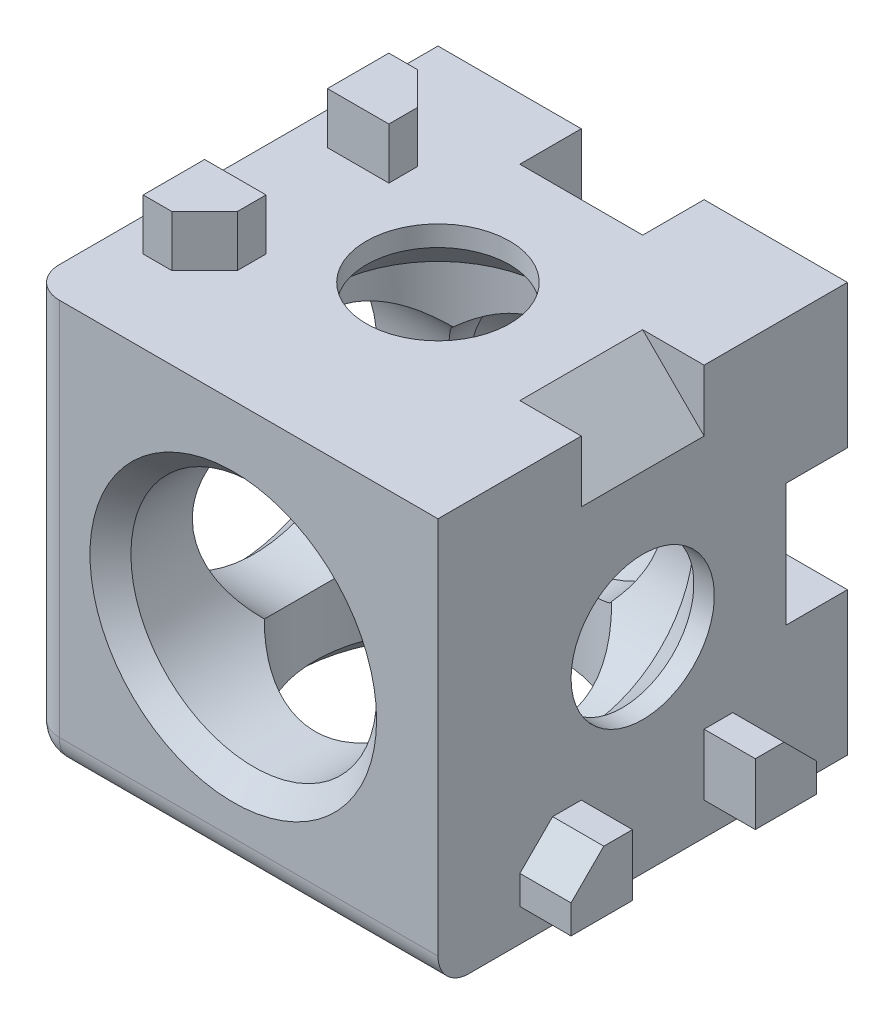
ISO-10303-21;
HEADER;
FILE_DESCRIPTION(('STEP AP214'),'2;1');
FILE_NAME('part.step','',(''),(''),'','','');
FILE_SCHEMA(('AUTOMOTIVE_DESIGN { 1 0 10303 214 1 1 1 1 }'));
ENDSEC;
DATA;
#1=APPLICATION_CONTEXT('core data for automotive mechanical design processes');
#2=APPLICATION_PROTOCOL_DEFINITION('international standard','automotive_design',2000,#1);
#3=PRODUCT_CONTEXT('',#1,'mechanical');
#4=PRODUCT('Part','Part','',(#3));
#5=PRODUCT_RELATED_PRODUCT_CATEGORY('part','',(#4));
#6=PRODUCT_DEFINITION_FORMATION('','',#4);
#7=PRODUCT_DEFINITION_CONTEXT('part definition',#1,'design');
#8=PRODUCT_DEFINITION('design','',#6,#7);
#9=PRODUCT_DEFINITION_SHAPE('','',#8);
#10=(LENGTH_UNIT() NAMED_UNIT(*) SI_UNIT(.MILLI.,.METRE.));
#11=(NAMED_UNIT(*) PLANE_ANGLE_UNIT() SI_UNIT($,.RADIAN.));
#12=(NAMED_UNIT(*) SI_UNIT($,.STERADIAN.) SOLID_ANGLE_UNIT());
#13=UNCERTAINTY_MEASURE_WITH_UNIT(LENGTH_MEASURE(1.E-05),#10,'distance_accuracy_value','');
#14=(GEOMETRIC_REPRESENTATION_CONTEXT(3) GLOBAL_UNCERTAINTY_ASSIGNED_CONTEXT((#13)) GLOBAL_UNIT_ASSIGNED_CONTEXT((#10,
#11,#12)) REPRESENTATION_CONTEXT('',''));
#15=CARTESIAN_POINT('',(0.,0.,0.));
#16=DIRECTION('',(0.,0.,1.));
#17=DIRECTION('',(1.,0.,0.));
#18=AXIS2_PLACEMENT_3D('',#15,#16,#17);
#19=CARTESIAN_POINT('',(7.,0.,10.));
#20=DIRECTION('',(-1.,0.,0.));
#21=DIRECTION('',(0.,0.,1.));
#22=AXIS2_PLACEMENT_3D('',#19,#20,#21);
#23=CYLINDRICAL_SURFACE('',#22,5.5);
#24=CARTESIAN_POINT('',(7.000000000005,0.,10.));
#25=DIRECTION('',(-1.,0.,0.));
#26=DIRECTION('',(0.,0.,1.));
#27=AXIS2_PLACEMENT_3D('',#24,#25,#26);
#28=CIRCLE('',#27,5.50000000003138);
#29=CARTESIAN_POINT('',(7.000000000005,0.,15.5000000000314));
#30=VERTEX_POINT('',#29);
#31=EDGE_CURVE('E425',#30,#30,#28,.F.);
#32=ORIENTED_EDGE('',*,*,#31,.T.);
#33=EDGE_LOOP('',(#32));
#34=FACE_BOUND('',#33,.T.);
#35=CARTESIAN_POINT('',(4.24264068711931,-3.50000000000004,5.75735931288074));
#36=CARTESIAN_POINT('',(4.3356118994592,-3.61265379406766,5.85032676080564));
#37=CARTESIAN_POINT('',(4.4274248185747,-3.72225560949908,5.94825742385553));
#38=CARTESIAN_POINT('',(4.60759938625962,-3.93487588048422,6.15437987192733));
#39=CARTESIAN_POINT('',(4.69595521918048,-4.037883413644,6.26258797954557));
#40=CARTESIAN_POINT('',(4.86855555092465,-4.23737283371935,6.49033432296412));
#41=CARTESIAN_POINT('',(4.95275521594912,-4.3337866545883,6.60996687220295));
#42=CARTESIAN_POINT('',(5.11469121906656,-4.51796332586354,6.85960264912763));
#43=CARTESIAN_POINT('',(5.19243175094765,-4.60573179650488,6.98959903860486));
#44=CARTESIAN_POINT('',(5.38070954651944,-4.81720602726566,7.33450983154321));
#45=CARTESIAN_POINT('',(5.48577993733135,-4.93414048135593,7.55681783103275));
#46=CARTESIAN_POINT('',(5.62440644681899,-5.08767325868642,7.90672297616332));
#47=CARTESIAN_POINT('',(5.66741771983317,-5.13516853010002,8.02596798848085));
#48=CARTESIAN_POINT('',(5.74645967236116,-5.22227310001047,8.26952085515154));
#49=CARTESIAN_POINT('',(5.78249395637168,-5.2618864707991,8.39382605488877));
#50=CARTESIAN_POINT('',(5.84719768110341,-5.33291072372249,8.64808769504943));
#51=CARTESIAN_POINT('',(5.87578830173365,-5.36423387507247,8.77808882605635));
#52=CARTESIAN_POINT('',(5.92447166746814,-5.41751623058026,9.04157526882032));
#53=CARTESIAN_POINT('',(5.9445643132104,-5.4394753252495,9.17506062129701));
#54=CARTESIAN_POINT('',(5.97575070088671,-5.47354029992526,9.44432720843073));
#55=CARTESIAN_POINT('',(5.98684457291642,-5.48564632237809,9.5801084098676));
#56=CARTESIAN_POINT('',(5.99974005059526,-5.49971716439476,9.85262704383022));
#57=CARTESIAN_POINT('',(6.00154295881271,-5.50168340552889,9.98936433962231));
#58=CARTESIAN_POINT('',(5.99621430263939,-5.49586993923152,10.2433972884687));
#59=CARTESIAN_POINT('',(5.99029035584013,-5.48940753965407,10.3607521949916));
#60=CARTESIAN_POINT('',(5.97164332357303,-5.46905299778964,10.5943093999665));
#61=CARTESIAN_POINT('',(5.9589180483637,-5.4551584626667,10.7105113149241));
#62=CARTESIAN_POINT('',(5.92692034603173,-5.42018770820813,10.9408050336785));
#63=CARTESIAN_POINT('',(5.90765376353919,-5.39911789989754,11.0548986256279));
#64=CARTESIAN_POINT('',(5.86292178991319,-5.35013550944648,11.2803853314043));
#65=CARTESIAN_POINT('',(5.83745395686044,-5.32222023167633,11.3917773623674));
#66=CARTESIAN_POINT('',(5.75237865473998,-5.22881746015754,11.7208523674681));
#67=CARTESIAN_POINT('',(5.68406736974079,-5.15363822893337,11.9336565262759));
#68=CARTESIAN_POINT('',(5.52809977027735,-4.98108880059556,12.342709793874));
#69=CARTESIAN_POINT('',(5.440403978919,-4.88367330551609,12.5389239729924));
#70=CARTESIAN_POINT('',(5.23255835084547,-4.65111596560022,12.9464445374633));
#71=CARTESIAN_POINT('',(5.10940886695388,-4.51234175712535,13.1541531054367));
#72=CARTESIAN_POINT('',(4.91371177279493,-4.28903658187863,13.4451499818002));
#73=CARTESIAN_POINT('',(4.84682264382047,-4.21227798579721,13.5385233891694));
#74=CARTESIAN_POINT('',(4.71000509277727,-4.05409706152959,13.7186829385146));
#75=CARTESIAN_POINT('',(4.64007949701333,-3.97267904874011,13.8054750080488));
#76=CARTESIAN_POINT('',(4.56891672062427,-3.88908729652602,13.889087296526));
#77=B_SPLINE_CURVE_WITH_KNOTS('',3,(#35,#36,#37,#38,#39,#40,#41,#42,#43,#44,#45,#46,#47,#48,#49,
#50,#51,#52,#53,#54,#55,#56,#57,#58,#59,#60,#61,#62,#63,#64,#65,#66,#67,#68,#69,#70,#71,#72,#73,
#74,#75,#76),.UNSPECIFIED.,.F.,.F.,(4,2,2,2,2,2,2,2,2,2,2,2,2,2,2,2,2,2,2,2,4),(0.,
0.519400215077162,1.03963959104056,1.56462259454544,2.0892620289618,2.90233931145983,
3.30804747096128,3.71354546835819,4.12317702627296,4.53281337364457,4.94244379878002,
5.35201679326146,5.70463194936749,6.05736070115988,6.40977511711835,6.76232853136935,
7.46676144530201,8.17264238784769,9.00503490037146,9.41926501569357,9.83311750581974),.UNSPECIFIED.);
#78=CARTESIAN_POINT('',(4.24264068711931,-3.5,5.75735931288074));
#79=VERTEX_POINT('',#78);
#80=CARTESIAN_POINT('',(4.56891672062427,-3.88908729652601,13.889087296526));
#81=VERTEX_POINT('',#80);
#82=EDGE_CURVE('E20',#79,#81,#77,.T.);
#83=ORIENTED_EDGE('',*,*,#82,.T.);
#84=CARTESIAN_POINT('',(4.56891672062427,-3.88908729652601,13.889087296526));
#85=CARTESIAN_POINT('',(4.65034913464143,-3.79340558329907,13.9847368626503));
#86=CARTESIAN_POINT('',(4.73016106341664,-3.69356304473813,14.0775473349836));
#87=CARTESIAN_POINT('',(4.88571975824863,-3.4852137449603,14.2570290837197));
#88=CARTESIAN_POINT('',(4.96146031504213,-3.37669434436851,14.3436910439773));
#89=CARTESIAN_POINT('',(5.18210478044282,-3.03631043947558,14.5946280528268));
#90=CARTESIAN_POINT('',(5.31914473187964,-2.79109010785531,14.7483584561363));
#91=CARTESIAN_POINT('',(5.54000619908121,-2.31593899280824,14.9943975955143));
#92=CARTESIAN_POINT('',(5.62898413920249,-2.09160956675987,15.0928101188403));
#93=CARTESIAN_POINT('',(5.74299615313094,-1.74155871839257,15.2184584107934));
#94=CARTESIAN_POINT('',(5.77771611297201,-1.62282376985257,15.2566342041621));
#95=CARTESIAN_POINT('',(5.84015597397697,-1.38134802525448,15.325187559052));
#96=CARTESIAN_POINT('',(5.86787761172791,-1.25860823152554,15.3555670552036));
#97=CARTESIAN_POINT('',(5.92724619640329,-0.950172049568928,15.4205628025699));
#98=CARTESIAN_POINT('',(5.95439916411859,-0.76251413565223,15.450223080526));
#99=CARTESIAN_POINT('',(5.99078037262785,-0.383210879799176,15.4899466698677));
#100=CARTESIAN_POINT('',(5.99999330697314,-0.191562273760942,15.4999932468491));
#101=CARTESIAN_POINT('',(6.00000442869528,0.126754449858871,15.5000044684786));
#102=CARTESIAN_POINT('',(5.99597807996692,0.253471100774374,15.4956131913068));
#103=CARTESIAN_POINT('',(5.97997472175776,0.505840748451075,15.4781484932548));
#104=CARTESIAN_POINT('',(5.96799606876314,0.631493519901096,15.4650732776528));
#105=CARTESIAN_POINT('',(5.93635236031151,0.880620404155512,15.4304997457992));
#106=CARTESIAN_POINT('',(5.9166884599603,1.00409484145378,15.4090026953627));
#107=CARTESIAN_POINT('',(5.87008294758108,1.24801967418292,15.3579829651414));
#108=CARTESIAN_POINT('',(5.84313815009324,1.36846872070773,15.3284567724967));
#109=CARTESIAN_POINT('',(5.78273770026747,1.60457882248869,15.2621517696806));
#110=CARTESIAN_POINT('',(5.74933542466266,1.72027029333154,15.2254323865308));
#111=CARTESIAN_POINT('',(5.67646450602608,1.94730328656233,15.1451463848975));
#112=CARTESIAN_POINT('',(5.63699321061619,2.05864288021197,15.1015767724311));
#113=CARTESIAN_POINT('',(5.51016789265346,2.38595679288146,14.9612071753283));
#114=CARTESIAN_POINT('',(5.41452230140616,2.5947712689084,14.8548772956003));
#115=CARTESIAN_POINT('',(5.23460435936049,2.93692991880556,14.6532301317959));
#116=CARTESIAN_POINT('',(5.15429930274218,3.07536753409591,14.5627663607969));
#117=CARTESIAN_POINT('',(4.98632078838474,3.34084818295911,14.3721189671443));
#118=CARTESIAN_POINT('',(4.89864077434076,3.46788086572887,14.2719266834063));
#119=CARTESIAN_POINT('',(4.71834844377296,3.70941107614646,14.0639284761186));
#120=CARTESIAN_POINT('',(4.62578071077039,3.82399994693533,13.9561891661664));
#121=CARTESIAN_POINT('',(4.4367758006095,4.04175300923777,13.7334097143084));
#122=CARTESIAN_POINT('',(4.3403468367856,4.14493986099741,13.6183847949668));
#123=CARTESIAN_POINT('',(4.24264068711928,4.24264068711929,13.5));
#124=B_SPLINE_CURVE_WITH_KNOTS('',3,(#84,#85,#86,#87,#88,#89,#90,#91,#92,#93,#94,#95,#96,#97,
#98,#99,#100,#101,#102,#103,#104,#105,#106,#107,#108,#109,#110,#111,#112,#113,#114,#115,#116,
#117,#118,#119,#120,#121,#122,#123),.UNSPECIFIED.,.F.,.F.,(4,2,2,2,2,2,2,2,2,2,2,2,2,2,2,2,2,2,
2,4),(0.,0.473536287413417,0.947775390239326,1.90356301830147,2.68205866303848,3.07002154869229,
3.45788806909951,4.03177764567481,4.60615665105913,4.98621632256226,5.36635456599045,
5.74643569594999,6.1266833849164,6.50391290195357,6.88130775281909,7.63754678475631,
8.18837601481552,8.73970021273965,9.28665619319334,9.83250482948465),.UNSPECIFIED.);
#125=CARTESIAN_POINT('',(4.24264068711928,4.24264068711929,13.5));
#126=VERTEX_POINT('',#125);
#127=EDGE_CURVE('E417',#81,#126,#124,.T.);
#128=ORIENTED_EDGE('',*,*,#127,.T.);
#129=CARTESIAN_POINT('',(0.,0.,10.));
#130=DIRECTION('',(-0.707106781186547,0.707106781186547,0.));
#131=DIRECTION('',(-0.707106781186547,-0.707106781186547,0.));
#132=AXIS2_PLACEMENT_3D('',#129,#130,#131);
#133=ELLIPSE('',#132,7.77817459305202,5.5);
#134=CARTESIAN_POINT('',(3.88908729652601,3.88908729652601,6.11091270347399));
#135=VERTEX_POINT('',#134);
#136=EDGE_CURVE('E349',#126,#135,#133,.T.);
#137=ORIENTED_EDGE('',*,*,#136,.T.);
#138=CARTESIAN_POINT('',(0.,0.,10.));
#139=DIRECTION('',(-0.707106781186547,0.,-0.707106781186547));
#140=DIRECTION('',(-0.707106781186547,0.,0.707106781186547));
#141=AXIS2_PLACEMENT_3D('',#138,#139,#140);
#142=ELLIPSE('',#141,7.77817459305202,5.5);
#143=EDGE_CURVE('E342',#135,#79,#142,.T.);
#144=ORIENTED_EDGE('',*,*,#143,.T.);
#145=EDGE_LOOP('',(#83,#128,#137,#144));
#146=FACE_BOUND('',#145,.T.);
#147=ADVANCED_FACE('F16',(#34,#146),#23,.F.);
#148=CARTESIAN_POINT('',(0.,0.,10.));
#149=DIRECTION('',(0.,-1.,0.));
#150=DIRECTION('',(0.,0.,-1.));
#151=AXIS2_PLACEMENT_3D('',#148,#149,#150);
#152=CYLINDRICAL_SURFACE('',#151,6.);
#153=ORIENTED_EDGE('',*,*,#82,.F.);
#154=CARTESIAN_POINT('',(4.24264068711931,-3.49999999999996,5.75735931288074));
#155=CARTESIAN_POINT('',(4.14968195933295,-3.612643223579,5.66439683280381));
#156=CARTESIAN_POINT('',(4.05176097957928,-3.72223501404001,5.57259244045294));
#157=CARTESIAN_POINT('',(3.845659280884,-3.93483711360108,5.39243366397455));
#158=CARTESIAN_POINT('',(3.73746218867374,-4.03783646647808,5.30408511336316));
#159=CARTESIAN_POINT('',(3.50971895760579,-4.23732918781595,5.13148249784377));
#160=CARTESIAN_POINT('',(3.39007661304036,-4.33375312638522,5.0472741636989));
#161=CARTESIAN_POINT('',(3.14042015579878,-4.51794794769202,4.88532240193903));
#162=CARTESIAN_POINT('',(3.01041294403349,-4.60572450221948,4.80757474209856));
#163=CARTESIAN_POINT('',(2.66544915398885,-4.81723109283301,4.61926813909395));
#164=CARTESIAN_POINT('',(2.44309464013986,-4.93418623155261,4.51417896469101));
#165=CARTESIAN_POINT('',(2.09315943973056,-5.0877211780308,4.37555018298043));
#166=CARTESIAN_POINT('',(1.97393486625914,-5.13520552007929,4.33254874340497));
#167=CARTESIAN_POINT('',(1.73042532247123,-5.22229010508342,4.25352486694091));
#168=CARTESIAN_POINT('',(1.6061431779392,-5.26189467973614,4.21749859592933));
#169=CARTESIAN_POINT('',(1.36171487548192,-5.33017287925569,4.15529649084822));
#170=CARTESIAN_POINT('',(1.24185049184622,-5.35940153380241,4.12862200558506));
#171=CARTESIAN_POINT('',(0.999142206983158,-5.40990446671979,4.08248696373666));
#172=CARTESIAN_POINT('',(0.876299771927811,-5.43118257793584,4.06302293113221));
#173=CARTESIAN_POINT('',(0.628429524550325,-5.46541275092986,4.03169295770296));
#174=CARTESIAN_POINT('',(0.503400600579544,-5.47836044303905,4.01983100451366));
#175=CARTESIAN_POINT('',(0.252247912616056,-5.49565410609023,4.00398448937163));
#176=CARTESIAN_POINT('',(0.126124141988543,-5.50000002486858,3.99999997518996));
#177=CARTESIAN_POINT('',(-0.126764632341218,-5.49999997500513,4.00000002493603));
#178=CARTESIAN_POINT('',(-0.253529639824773,-5.49560975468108,4.00402516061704));
#179=CARTESIAN_POINT('',(-0.50595004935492,-5.47814031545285,4.0200326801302));
#180=CARTESIAN_POINT('',(-0.631605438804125,-5.46506099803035,4.03201515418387));
#181=CARTESIAN_POINT('',(-0.880714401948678,-5.43048344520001,4.06366257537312));
#182=CARTESIAN_POINT('',(-1.00416878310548,-5.40898836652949,4.08332464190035));
#183=CARTESIAN_POINT('',(-1.24805558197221,-5.35797431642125,4.12992494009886));
#184=CARTESIAN_POINT('',(-1.36848659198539,-5.32845168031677,4.15686649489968));
#185=CARTESIAN_POINT('',(-1.60463037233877,-5.26213736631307,4.21727541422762));
#186=CARTESIAN_POINT('',(-1.7203713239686,-5.22540073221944,4.25069333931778));
#187=CARTESIAN_POINT('',(-1.94749933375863,-5.14507297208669,4.3236020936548));
#188=CARTESIAN_POINT('',(-2.05888463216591,-5.10147911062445,4.36309534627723));
#189=CARTESIAN_POINT('',(-2.38612330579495,-4.96112372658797,4.4899068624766));
#190=CARTESIAN_POINT('',(-2.59480020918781,-4.85486301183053,4.58548854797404));
#191=CARTESIAN_POINT('',(-2.99968183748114,-4.61624513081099,4.79839717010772));
#192=CARTESIAN_POINT('',(-3.19488651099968,-4.4829202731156,4.9165158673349));
#193=CARTESIAN_POINT('',(-3.46914805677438,-4.26946551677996,5.10335159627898));
#194=CARTESIAN_POINT('',(-3.55725565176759,-4.19629387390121,5.16704721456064));
#195=CARTESIAN_POINT('',(-3.72756047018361,-4.04576012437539,5.29715423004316));
#196=CARTESIAN_POINT('',(-3.80976170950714,-3.96840092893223,5.36356373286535));
#197=CARTESIAN_POINT('',(-3.88908729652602,-3.88908729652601,5.43108327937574));
#198=B_SPLINE_CURVE_WITH_KNOTS('',3,(#154,#155,#156,#157,#158,#159,#160,#161,#162,#163,#164,
#165,#166,#167,#168,#169,#170,#171,#172,#173,#174,#175,#176,#177,#178,#179,#180,#181,#182,#183,
#184,#185,#186,#187,#188,#189,#190,#191,#192,#193,#194,#195,#196,#197),.UNSPECIFIED.,.F.,.F.,(4,
2,2,2,2,2,2,2,2,2,2,2,2,2,2,2,2,2,2,2,2,4),(0.,0.519351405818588,1.03954465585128,
1.56457668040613,2.08926201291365,2.90249747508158,3.30813309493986,3.71354510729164,
4.09176270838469,4.46979774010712,4.84803090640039,5.226266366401,5.60642260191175,
5.98658314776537,6.3666012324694,6.74679309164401,7.12418948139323,7.50173680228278,
8.25765710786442,9.04798509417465,9.4409448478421,9.833634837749),.UNSPECIFIED.);
#199=CARTESIAN_POINT('',(-3.88908729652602,-3.88908729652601,5.43108327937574));
#200=VERTEX_POINT('',#199);
#201=EDGE_CURVE('E337',#79,#200,#198,.T.);
#202=ORIENTED_EDGE('',*,*,#201,.T.);
#203=CARTESIAN_POINT('',(0.,0.,10.));
#204=DIRECTION('',(0.707106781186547,-0.707106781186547,0.));
#205=DIRECTION('',(-0.707106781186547,-0.707106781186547,0.));
#206=AXIS2_PLACEMENT_3D('',#203,#204,#205);
#207=ELLIPSE('',#206,8.48528137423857,6.);
#208=CARTESIAN_POINT('',(-4.24264068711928,-4.24264068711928,14.2426406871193));
#209=VERTEX_POINT('',#208);
#210=EDGE_CURVE('E1679',#200,#209,#207,.F.);
#211=ORIENTED_EDGE('',*,*,#210,.T.);
#212=CARTESIAN_POINT('',(0.,0.,10.));
#213=DIRECTION('',(0.,-0.707106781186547,-0.707106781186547));
#214=DIRECTION('',(0.,-0.707106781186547,0.707106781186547));
#215=AXIS2_PLACEMENT_3D('',#212,#213,#214);
#216=ELLIPSE('',#215,8.48528137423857,6.);
#217=EDGE_CURVE('E355',#209,#81,#216,.F.);
#218=ORIENTED_EDGE('',*,*,#217,.T.);
#219=EDGE_LOOP('',(#153,#202,#211,#218));
#220=FACE_BOUND('',#219,.T.);
#221=CARTESIAN_POINT('',(0.,-9.00000000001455,10.));
#222=DIRECTION('',(0.,-1.,0.));
#223=DIRECTION('',(0.,0.,-1.));
#224=AXIS2_PLACEMENT_3D('',#221,#222,#223);
#225=CIRCLE('',#224,5.9999999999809);
#226=CARTESIAN_POINT('',(0.,-9.00000000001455,4.0000000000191));
#227=VERTEX_POINT('',#226);
#228=EDGE_CURVE('E383',#227,#227,#225,.T.);
#229=ORIENTED_EDGE('',*,*,#228,.T.);
#230=EDGE_LOOP('',(#229));
#231=FACE_BOUND('',#230,.T.);
#232=ADVANCED_FACE('F353',(#220,#231),#152,.F.);
#233=CARTESIAN_POINT('',(0.,0.,3.));
#234=DIRECTION('',(0.,0.,1.));
#235=DIRECTION('',(1.,0.,0.));
#236=AXIS2_PLACEMENT_3D('',#233,#234,#235);
#237=CYLINDRICAL_SURFACE('',#236,5.5);
#238=ORIENTED_EDGE('',*,*,#143,.F.);
#239=CARTESIAN_POINT('',(0.,0.,10.));
#240=DIRECTION('',(0.,0.707106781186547,0.707106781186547));
#241=DIRECTION('',(0.,-0.707106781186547,0.707106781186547));
#242=AXIS2_PLACEMENT_3D('',#239,#240,#241);
#243=ELLIPSE('',#242,7.77817459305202,5.5);
#244=CARTESIAN_POINT('',(-3.49999999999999,4.24264068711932,5.75735931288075));
#245=VERTEX_POINT('',#244);
#246=EDGE_CURVE('E424',#135,#245,#243,.T.);
#247=ORIENTED_EDGE('',*,*,#246,.T.);
#248=CARTESIAN_POINT('',(-3.49999999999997,4.24264068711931,5.75735931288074));
#249=CARTESIAN_POINT('',(-3.61264322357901,4.14968195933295,5.6643968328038));
#250=CARTESIAN_POINT('',(-3.72223501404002,4.05176097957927,5.57259244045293));
#251=CARTESIAN_POINT('',(-3.93483711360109,3.84565928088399,5.39243366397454));
#252=CARTESIAN_POINT('',(-4.03783646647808,3.73746218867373,5.30408511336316));
#253=CARTESIAN_POINT('',(-4.23732918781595,3.50971895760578,5.13148249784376));
#254=CARTESIAN_POINT('',(-4.33375312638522,3.39007661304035,5.0472741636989));
#255=CARTESIAN_POINT('',(-4.51794794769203,3.14042015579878,4.88532240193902));
#256=CARTESIAN_POINT('',(-4.60572450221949,3.01041294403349,4.80757474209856));
#257=CARTESIAN_POINT('',(-4.81723109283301,2.66544915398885,4.61926813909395));
#258=CARTESIAN_POINT('',(-4.93418623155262,2.44309464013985,4.514178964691));
#259=CARTESIAN_POINT('',(-5.0877211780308,2.09315943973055,4.37555018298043));
#260=CARTESIAN_POINT('',(-5.13520552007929,1.97393486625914,4.33254874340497));
#261=CARTESIAN_POINT('',(-5.22229010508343,1.73042532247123,4.25352486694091));
#262=CARTESIAN_POINT('',(-5.26189467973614,1.60614317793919,4.21749859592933));
#263=CARTESIAN_POINT('',(-5.33017287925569,1.36171487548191,4.15529649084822));
#264=CARTESIAN_POINT('',(-5.35940153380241,1.24185049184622,4.12862200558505));
#265=CARTESIAN_POINT('',(-5.40990446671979,0.999142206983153,4.08248696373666));
#266=CARTESIAN_POINT('',(-5.43118257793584,0.876299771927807,4.06302293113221));
#267=CARTESIAN_POINT('',(-5.46541275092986,0.628429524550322,4.03169295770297));
#268=CARTESIAN_POINT('',(-5.47836044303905,0.503400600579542,4.01983100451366));
#269=CARTESIAN_POINT('',(-5.49565410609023,0.252247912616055,4.00398448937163));
#270=CARTESIAN_POINT('',(-5.50000002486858,0.126124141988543,3.99999997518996));
#271=CARTESIAN_POINT('',(-5.49999997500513,-0.126764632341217,4.00000002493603));
#272=CARTESIAN_POINT('',(-5.49560975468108,-0.253529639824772,4.00402516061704));
#273=CARTESIAN_POINT('',(-5.47814031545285,-0.505950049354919,4.0200326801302));
#274=CARTESIAN_POINT('',(-5.46506099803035,-0.631605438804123,4.03201515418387));
#275=CARTESIAN_POINT('',(-5.43048344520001,-0.880714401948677,4.06366257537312));
#276=CARTESIAN_POINT('',(-5.40898836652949,-1.00416878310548,4.08332464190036));
#277=CARTESIAN_POINT('',(-5.35797431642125,-1.24805558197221,4.12992494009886));
#278=CARTESIAN_POINT('',(-5.32845168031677,-1.36848659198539,4.15686649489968));
#279=CARTESIAN_POINT('',(-5.26213736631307,-1.60463037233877,4.21727541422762));
#280=CARTESIAN_POINT('',(-5.22540073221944,-1.7203713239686,4.25069333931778));
#281=CARTESIAN_POINT('',(-5.14507297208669,-1.94749933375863,4.3236020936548));
#282=CARTESIAN_POINT('',(-5.10147911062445,-2.05888463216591,4.36309534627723));
#283=CARTESIAN_POINT('',(-4.96112372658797,-2.38612330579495,4.4899068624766));
#284=CARTESIAN_POINT('',(-4.85486301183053,-2.59480020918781,4.58548854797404));
#285=CARTESIAN_POINT('',(-4.61624513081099,-2.99968183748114,4.79839717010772));
#286=CARTESIAN_POINT('',(-4.4829202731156,-3.19488651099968,4.9165158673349));
#287=CARTESIAN_POINT('',(-4.26946551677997,-3.46914805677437,5.10335159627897));
#288=CARTESIAN_POINT('',(-4.19629387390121,-3.55725565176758,5.16704721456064));
#289=CARTESIAN_POINT('',(-4.0457601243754,-3.72756047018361,5.29715423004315));
#290=CARTESIAN_POINT('',(-3.96840092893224,-3.80976170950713,5.36356373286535));
#291=CARTESIAN_POINT('',(-3.88908729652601,-3.88908729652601,5.43108327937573));
#292=B_SPLINE_CURVE_WITH_KNOTS('',3,(#248,#249,#250,#251,#252,#253,#254,#255,#256,#257,#258,
#259,#260,#261,#262,#263,#264,#265,#266,#267,#268,#269,#270,#271,#272,#273,#274,#275,#276,#277,
#278,#279,#280,#281,#282,#283,#284,#285,#286,#287,#288,#289,#290,#291),.UNSPECIFIED.,.F.,.F.,(4,
2,2,2,2,2,2,2,2,2,2,2,2,2,2,2,2,2,2,2,2,4),(0.,0.519351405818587,1.03954465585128,
1.56457668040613,2.08926201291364,2.90249747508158,3.30813309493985,3.71354510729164,
4.09176270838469,4.46979774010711,4.84803090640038,5.22626636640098,5.60642260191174,
5.98658314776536,6.36660123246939,6.74679309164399,7.12418948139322,7.50173680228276,
8.25765710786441,9.04798509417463,9.44094484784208,9.83363483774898),.UNSPECIFIED.);
#293=EDGE_CURVE('E345',#245,#200,#292,.T.);
#294=ORIENTED_EDGE('',*,*,#293,.T.);
#295=ORIENTED_EDGE('',*,*,#201,.F.);
#296=EDGE_LOOP('',(#238,#247,#294,#295));
#297=FACE_BOUND('',#296,.T.);
#298=CARTESIAN_POINT('',(0.,0.,2.99999999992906));
#299=DIRECTION('',(0.,0.,1.));
#300=DIRECTION('',(1.,0.,0.));
#301=AXIS2_PLACEMENT_3D('',#298,#299,#300);
#302=CIRCLE('',#301,5.49999999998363);
#303=CARTESIAN_POINT('',(5.49999999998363,0.,2.99999999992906));
#304=VERTEX_POINT('',#303);
#305=EDGE_CURVE('E583',#304,#304,#302,.F.);
#306=ORIENTED_EDGE('',*,*,#305,.T.);
#307=EDGE_LOOP('',(#306));
#308=FACE_BOUND('',#307,.T.);
#309=ADVANCED_FACE('F339',(#297,#308),#237,.F.);
#310=CARTESIAN_POINT('',(0.,7.,10.));
#311=DIRECTION('',(0.,-1.,0.));
#312=DIRECTION('',(0.,0.,-1.));
#313=AXIS2_PLACEMENT_3D('',#310,#311,#312);
#314=CYLINDRICAL_SURFACE('',#313,5.5);
#315=ORIENTED_EDGE('',*,*,#246,.F.);
#316=ORIENTED_EDGE('',*,*,#136,.F.);
#317=CARTESIAN_POINT('',(4.24264068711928,4.24264068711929,13.5));
#318=CARTESIAN_POINT('',(4.14968195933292,4.33560316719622,13.612643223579));
#319=CARTESIAN_POINT('',(4.05176097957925,4.42740755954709,13.72223501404));
#320=CARTESIAN_POINT('',(3.84565928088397,4.60756633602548,13.9348371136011));
#321=CARTESIAN_POINT('',(3.7374621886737,4.69591488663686,14.0378364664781));
#322=CARTESIAN_POINT('',(3.50971895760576,4.86851750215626,14.237329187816));
#323=CARTESIAN_POINT('',(3.39007661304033,4.95272583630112,14.3337531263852));
#324=CARTESIAN_POINT('',(3.14042015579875,5.11467759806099,14.517947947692));
#325=CARTESIAN_POINT('',(3.01041294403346,5.19242525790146,14.6057245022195));
#326=CARTESIAN_POINT('',(2.66544915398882,5.38073186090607,14.817231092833));
#327=CARTESIAN_POINT('',(2.44309464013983,5.48582103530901,14.9341862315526));
#328=CARTESIAN_POINT('',(2.09315943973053,5.62444981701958,15.0877211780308));
#329=CARTESIAN_POINT('',(1.97393486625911,5.66745125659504,15.1352055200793));
#330=CARTESIAN_POINT('',(1.7304253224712,5.7464751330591,15.2222901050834));
#331=CARTESIAN_POINT('',(1.60614317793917,5.78250140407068,15.2618946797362));
#332=CARTESIAN_POINT('',(1.36171487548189,5.84470350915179,15.3301728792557));
#333=CARTESIAN_POINT('',(1.2418504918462,5.87137799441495,15.3594015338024));
#334=CARTESIAN_POINT('',(0.999142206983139,5.91751303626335,15.4099044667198));
#335=CARTESIAN_POINT('',(0.876299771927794,5.93697706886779,15.4311825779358));
#336=CARTESIAN_POINT('',(0.628429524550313,5.96830704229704,15.4654127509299));
#337=CARTESIAN_POINT('',(0.503400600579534,5.98016899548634,15.4783604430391));
#338=CARTESIAN_POINT('',(0.252247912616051,5.99601551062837,15.4956541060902));
#339=CARTESIAN_POINT('',(0.126124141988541,6.00000002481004,15.5000000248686));
#340=CARTESIAN_POINT('',(-0.126764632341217,5.99999997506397,15.4999999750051));
#341=CARTESIAN_POINT('',(-0.253529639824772,5.99597483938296,15.4956097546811));
#342=CARTESIAN_POINT('',(-0.50595004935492,5.9799673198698,15.4781403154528));
#343=CARTESIAN_POINT('',(-0.631605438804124,5.96798484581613,15.4650609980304));
#344=CARTESIAN_POINT('',(-0.880714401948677,5.93633742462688,15.4304834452));
#345=CARTESIAN_POINT('',(-1.00416878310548,5.91667535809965,15.4089883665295));
#346=CARTESIAN_POINT('',(-1.24805558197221,5.87007505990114,15.3579743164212));
#347=CARTESIAN_POINT('',(-1.36848659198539,5.84313350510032,15.3284516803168));
#348=CARTESIAN_POINT('',(-1.60463037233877,5.78272458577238,15.2621373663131));
#349=CARTESIAN_POINT('',(-1.7203713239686,5.74930666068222,15.2254007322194));
#350=CARTESIAN_POINT('',(-1.94749933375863,5.6763979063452,15.1450729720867));
#351=CARTESIAN_POINT('',(-2.05888463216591,5.63690465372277,15.1014791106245));
#352=CARTESIAN_POINT('',(-2.38612330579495,5.5100931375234,14.961123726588));
#353=CARTESIAN_POINT('',(-2.59480020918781,5.41451145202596,14.8548630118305));
#354=CARTESIAN_POINT('',(-2.99968183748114,5.20160282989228,14.616245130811));
#355=CARTESIAN_POINT('',(-3.19488651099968,5.0834841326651,14.4829202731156));
#356=CARTESIAN_POINT('',(-3.46914805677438,4.89664840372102,14.26946551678));
#357=CARTESIAN_POINT('',(-3.55725565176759,4.83295278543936,14.1962938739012));
#358=CARTESIAN_POINT('',(-3.72756047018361,4.70284576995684,14.0457601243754));
#359=CARTESIAN_POINT('',(-3.80976170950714,4.63643626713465,13.9684009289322));
#360=CARTESIAN_POINT('',(-3.88908729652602,4.56891672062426,13.889087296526));
#361=B_SPLINE_CURVE_WITH_KNOTS('',3,(#317,#318,#319,#320,#321,#322,#323,#324,#325,#326,#327,
#328,#329,#330,#331,#332,#333,#334,#335,#336,#337,#338,#339,#340,#341,#342,#343,#344,#345,#346,
#347,#348,#349,#350,#351,#352,#353,#354,#355,#356,#357,#358,#359,#360),.UNSPECIFIED.,.F.,.F.,(4,
2,2,2,2,2,2,2,2,2,2,2,2,2,2,2,2,2,2,2,2,4),(0.,0.519351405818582,1.03954465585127,
1.56457668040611,2.08926201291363,2.90249747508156,3.30813309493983,3.71354510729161,
4.09176270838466,4.46979774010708,4.84803090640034,5.22626636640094,5.60642260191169,
5.98658314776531,6.36660123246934,6.74679309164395,7.12418948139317,7.50173680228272,
8.25765710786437,9.04798509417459,9.44094484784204,9.83363483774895),.UNSPECIFIED.);
#362=CARTESIAN_POINT('',(-3.88908729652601,4.56891672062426,13.889087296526));
#363=VERTEX_POINT('',#362);
#364=EDGE_CURVE('E410',#126,#363,#361,.T.);
#365=ORIENTED_EDGE('',*,*,#364,.T.);
#366=CARTESIAN_POINT('',(-3.88908729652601,4.56891672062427,13.889087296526));
#367=CARTESIAN_POINT('',(-3.98476785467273,4.65037553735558,13.793374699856));
#368=CARTESIAN_POINT('',(-4.07760756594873,4.73021286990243,13.6934982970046));
#369=CARTESIAN_POINT('',(-4.25714200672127,4.88581803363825,13.4850774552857));
#370=CARTESIAN_POINT('',(-4.34382752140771,4.96157972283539,13.3765205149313));
#371=CARTESIAN_POINT('',(-4.59472432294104,5.1821906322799,13.0361571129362));
#372=CARTESIAN_POINT('',(-4.74840089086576,5.31918284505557,12.7910093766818));
#373=CARTESIAN_POINT('',(-4.99433553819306,5.53995047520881,12.3160578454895));
#374=CARTESIAN_POINT('',(-5.09269955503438,5.62888413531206,12.0918581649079));
#375=CARTESIAN_POINT('',(-5.218352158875,5.74289958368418,11.7418843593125));
#376=CARTESIAN_POINT('',(-5.25655885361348,5.77764760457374,11.6230789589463));
#377=CARTESIAN_POINT('',(-5.32515908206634,5.84012991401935,11.3814585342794));
#378=CARTESIAN_POINT('',(-5.35555595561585,5.8678672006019,11.2586452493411));
#379=CARTESIAN_POINT('',(-5.40821821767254,5.91597064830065,11.008768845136));
#380=CARTESIAN_POINT('',(-5.43041462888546,5.93627426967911,10.8816790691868));
#381=CARTESIAN_POINT('',(-5.46588073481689,5.96873529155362,10.6252208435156));
#382=CARTESIAN_POINT('',(-5.47915033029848,5.98089260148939,10.4958523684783));
#383=CARTESIAN_POINT('',(-5.49648125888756,5.99677364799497,10.2359339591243));
#384=CARTESIAN_POINT('',(-5.5005391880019,6.00049426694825,10.1053836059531));
#385=CARTESIAN_POINT('',(-5.49934604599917,5.99940053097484,9.84436861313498));
#386=CARTESIAN_POINT('',(-5.49409582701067,5.99458695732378,9.71390396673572));
#387=CARTESIAN_POINT('',(-5.47553100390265,5.97757711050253,9.46908575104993));
#388=CARTESIAN_POINT('',(-5.4632044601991,5.96628546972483,9.35459175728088));
#389=CARTESIAN_POINT('',(-5.43154336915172,5.93730769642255,9.12736024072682));
#390=CARTESIAN_POINT('',(-5.4122065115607,5.91961945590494,9.01462330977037));
#391=CARTESIAN_POINT('',(-5.36684784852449,5.87817749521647,8.79175249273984));
#392=CARTESIAN_POINT('',(-5.34083220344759,5.85442936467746,8.6816163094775));
#393=CARTESIAN_POINT('',(-5.2824850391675,5.80125033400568,8.46441614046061));
#394=CARTESIAN_POINT('',(-5.25015114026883,5.77181729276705,8.35735332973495));
#395=CARTESIAN_POINT('',(-5.14159555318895,5.67318757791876,8.03352288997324));
#396=CARTESIAN_POINT('',(-5.05556780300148,5.59526539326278,7.82258205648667));
#397=CARTESIAN_POINT('',(-4.861836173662,5.42085468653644,7.41873122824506));
#398=CARTESIAN_POINT('',(-4.75407973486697,5.32432117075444,7.22586664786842));
#399=CARTESIAN_POINT('',(-4.55696933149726,5.14923380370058,6.91675278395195));
#400=CARTESIAN_POINT('',(-4.47229919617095,5.07441184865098,6.7953165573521));
#401=CARTESIAN_POINT('',(-4.29535808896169,4.91917680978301,6.56177852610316));
#402=CARTESIAN_POINT('',(-4.2030825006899,4.83876033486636,6.4496824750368));
#403=CARTESIAN_POINT('',(-4.01240241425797,4.67408322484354,6.23555108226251));
#404=CARTESIAN_POINT('',(-3.91403964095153,4.58984963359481,6.13345746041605));
#405=CARTESIAN_POINT('',(-3.71136637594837,4.41830315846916,5.93854258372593));
#406=CARTESIAN_POINT('',(-3.6070644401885,4.33099477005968,5.84570849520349));
#407=CARTESIAN_POINT('',(-3.50000000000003,4.24264068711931,5.75735931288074));
#408=B_SPLINE_CURVE_WITH_KNOTS('',3,(#366,#367,#368,#369,#370,#371,#372,#373,#374,#375,#376,
#377,#378,#379,#380,#381,#382,#383,#384,#385,#386,#387,#388,#389,#390,#391,#392,#393,#394,#395,
#396,#397,#398,#399,#400,#401,#402,#403,#404,#405,#406,#407),.UNSPECIFIED.,.F.,.F.,(4,2,2,2,2,2,
2,2,2,2,2,2,2,2,2,2,2,2,2,2,4),(0.,0.473689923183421,0.948074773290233,1.90356382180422,
2.68162247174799,3.06983932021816,3.4578898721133,3.84913391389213,4.24038230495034,
4.63177525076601,5.02313236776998,5.36985412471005,5.71669024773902,6.06320759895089,
6.40985571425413,7.12925127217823,7.85040831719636,8.34751278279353,8.84492123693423,
9.33923355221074,9.83285094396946),.UNSPECIFIED.);
#409=EDGE_CURVE('E384',#363,#245,#408,.T.);
#410=ORIENTED_EDGE('',*,*,#409,.T.);
#411=EDGE_LOOP('',(#315,#316,#365,#410));
#412=FACE_BOUND('',#411,.T.);
#413=CARTESIAN_POINT('',(0.,7.00000000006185,10.));
#414=DIRECTION('',(0.,-1.,0.));
#415=DIRECTION('',(0.,0.,-1.));
#416=AXIS2_PLACEMENT_3D('',#413,#414,#415);
#417=CIRCLE('',#416,5.49999999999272);
#418=CARTESIAN_POINT('',(0.,7.00000000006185,4.50000000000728));
#419=VERTEX_POINT('',#418);
#420=EDGE_CURVE('E580',#419,#419,#417,.F.);
#421=ORIENTED_EDGE('',*,*,#420,.T.);
#422=EDGE_LOOP('',(#421));
#423=FACE_BOUND('',#422,.T.);
#424=ADVANCED_FACE('F371',(#412,#423),#314,.F.);
#425=CARTESIAN_POINT('',(7.000000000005,0.,10.));
#426=DIRECTION('',(-1.,0.,0.));
#427=DIRECTION('',(0.,0.,1.));
#428=AXIS2_PLACEMENT_3D('',#425,#426,#427);
#429=CONICAL_SURFACE('',#428,5.50000000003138,0.785398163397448);
#430=ORIENTED_EDGE('',*,*,#31,.F.);
#431=EDGE_LOOP('',(#430));
#432=FACE_BOUND('',#431,.T.);
#433=CARTESIAN_POINT('',(9.,0.,10.));
#434=DIRECTION('',(-1.,0.,0.));
#435=DIRECTION('',(0.,0.,1.));
#436=AXIS2_PLACEMENT_3D('',#433,#434,#435);
#437=CIRCLE('',#436,3.5);
#438=CARTESIAN_POINT('',(9.,0.,13.5));
#439=VERTEX_POINT('',#438);
#440=EDGE_CURVE('E576',#439,#439,#437,.F.);
#441=ORIENTED_EDGE('',*,*,#440,.T.);
#442=EDGE_LOOP('',(#441));
#443=FACE_BOUND('',#442,.T.);
#444=ADVANCED_FACE('F1620',(#432,#443),#429,.F.);
#445=CARTESIAN_POINT('',(12.5,-7.07500913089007,14.32499086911));
#446=DIRECTION('',(-1.,0.,0.));
#447=DIRECTION('',(0.,0.,1.));
#448=AXIS2_PLACEMENT_3D('',#445,#446,#447);
#449=PLANE('',#448);
#450=DIRECTION('',(0.,0.,-1.));
#451=VECTOR('',#450,1.);
#452=CARTESIAN_POINT('',(12.5,-8.40000000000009,16.));
#453=LINE('',#452,#451);
#454=CARTESIAN_POINT('',(12.5,-8.40000000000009,13.));
#455=VERTEX_POINT('',#454);
#456=CARTESIAN_POINT('',(12.5,-8.40000000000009,16.));
#457=VERTEX_POINT('',#456);
#458=EDGE_CURVE('E579',#455,#457,#453,.F.);
#459=ORIENTED_EDGE('',*,*,#458,.F.);
#460=DIRECTION('',(0.,1.,0.));
#461=VECTOR('',#460,1.);
#462=CARTESIAN_POINT('',(12.5,-8.40000000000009,13.));
#463=LINE('',#462,#461);
#464=CARTESIAN_POINT('',(12.5,-5.4000000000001,13.));
#465=VERTEX_POINT('',#464);
#466=EDGE_CURVE('E873',#465,#455,#463,.F.);
#467=ORIENTED_EDGE('',*,*,#466,.F.);
#468=DIRECTION('',(0.,0.,1.));
#469=VECTOR('',#468,1.);
#470=CARTESIAN_POINT('',(12.5,-5.40000000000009,13.));
#471=LINE('',#470,#469);
#472=CARTESIAN_POINT('',(12.5,-5.40000000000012,14.4000000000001));
#473=VERTEX_POINT('',#472);
#474=EDGE_CURVE('E427',#473,#465,#471,.F.);
#475=ORIENTED_EDGE('',*,*,#474,.F.);
#476=DIRECTION('',(0.,-0.70710678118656,0.707106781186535));
#477=VECTOR('',#476,1.);
#478=CARTESIAN_POINT('',(12.5,-5.40000000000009,14.4000000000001));
#479=LINE('',#478,#477);
#480=CARTESIAN_POINT('',(12.5,-7.00000000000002,16.));
#481=VERTEX_POINT('',#480);
#482=EDGE_CURVE('E866',#481,#473,#479,.F.);
#483=ORIENTED_EDGE('',*,*,#482,.F.);
#484=DIRECTION('',(0.,-1.,0.));
#485=VECTOR('',#484,1.);
#486=CARTESIAN_POINT('',(12.5,-7.,16.));
#487=LINE('',#486,#485);
#488=EDGE_CURVE('E573',#457,#481,#487,.F.);
#489=ORIENTED_EDGE('',*,*,#488,.F.);
#490=EDGE_LOOP('',(#459,#467,#475,#483,#489));
#491=FACE_BOUND('',#490,.T.);
#492=ADVANCED_FACE('F1611',(#491),#449,.F.);
#493=CARTESIAN_POINT('',(12.5,-5.40000000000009,13.));
#494=DIRECTION('',(0.,1.,0.));
#495=DIRECTION('',(0.,0.,1.));
#496=AXIS2_PLACEMENT_3D('',#493,#494,#495);
#497=PLANE('',#496);
#498=DIRECTION('',(0.,0.,1.));
#499=VECTOR('',#498,1.);
#500=CARTESIAN_POINT('',(10.,-5.40000000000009,13.));
#501=LINE('',#500,#499);
#502=CARTESIAN_POINT('',(10.,-5.40000000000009,13.));
#503=VERTEX_POINT('',#502);
#504=CARTESIAN_POINT('',(10.,-5.40000000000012,14.4000000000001));
#505=VERTEX_POINT('',#504);
#506=EDGE_CURVE('E431',#503,#505,#501,.T.);
#507=ORIENTED_EDGE('',*,*,#506,.T.);
#508=DIRECTION('',(1.,0.,0.));
#509=VECTOR('',#508,1.);
#510=CARTESIAN_POINT('',(12.5,-5.4000000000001,14.4000000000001));
#511=LINE('',#510,#509);
#512=EDGE_CURVE('E863',#473,#505,#511,.F.);
#513=ORIENTED_EDGE('',*,*,#512,.F.);
#514=ORIENTED_EDGE('',*,*,#474,.T.);
#515=DIRECTION('',(1.,0.,0.));
#516=VECTOR('',#515,1.);
#517=CARTESIAN_POINT('',(12.5,-5.40000000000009,13.));
#518=LINE('',#517,#516);
#519=EDGE_CURVE('E868',#503,#465,#518,.T.);
#520=ORIENTED_EDGE('',*,*,#519,.F.);
#521=EDGE_LOOP('',(#507,#513,#514,#520));
#522=FACE_BOUND('',#521,.T.);
#523=ADVANCED_FACE('F1602',(#522),#497,.T.);
#524=CARTESIAN_POINT('',(12.5,-7.,16.));
#525=DIRECTION('',(0.,0.,1.));
#526=DIRECTION('',(0.,-1.,0.));
#527=AXIS2_PLACEMENT_3D('',#524,#525,#526);
#528=PLANE('',#527);
#529=DIRECTION('',(0.,-1.,0.));
#530=VECTOR('',#529,1.);
#531=CARTESIAN_POINT('',(10.,-7.,16.));
#532=LINE('',#531,#530);
#533=CARTESIAN_POINT('',(10.,-7.00000000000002,16.));
#534=VERTEX_POINT('',#533);
#535=CARTESIAN_POINT('',(10.,-8.40000000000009,16.));
#536=VERTEX_POINT('',#535);
#537=EDGE_CURVE('E571',#534,#536,#532,.T.);
#538=ORIENTED_EDGE('',*,*,#537,.T.);
#539=DIRECTION('',(1.,0.,0.));
#540=VECTOR('',#539,1.);
#541=CARTESIAN_POINT('',(12.5,-8.40000000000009,16.));
#542=LINE('',#541,#540);
#543=EDGE_CURVE('E875',#457,#536,#542,.F.);
#544=ORIENTED_EDGE('',*,*,#543,.F.);
#545=ORIENTED_EDGE('',*,*,#488,.T.);
#546=DIRECTION('',(1.,0.,0.));
#547=VECTOR('',#546,1.);
#548=CARTESIAN_POINT('',(12.5,-7.00000000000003,16.));
#549=LINE('',#548,#547);
#550=EDGE_CURVE('E860',#534,#481,#549,.T.);
#551=ORIENTED_EDGE('',*,*,#550,.F.);
#552=EDGE_LOOP('',(#538,#544,#545,#551));
#553=FACE_BOUND('',#552,.T.);
#554=ADVANCED_FACE('F1593',(#553),#528,.T.);
#555=CARTESIAN_POINT('',(12.5,-5.40000000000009,5.60000000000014));
#556=DIRECTION('',(0.,1.,0.));
#557=DIRECTION('',(0.,0.,1.));
#558=AXIS2_PLACEMENT_3D('',#555,#556,#557);
#559=PLANE('',#558);
#560=DIRECTION('',(0.,0.,1.));
#561=VECTOR('',#560,1.);
#562=CARTESIAN_POINT('',(10.,-5.40000000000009,5.60000000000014));
#563=LINE('',#562,#561);
#564=CARTESIAN_POINT('',(10.,-5.40000000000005,5.60000000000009));
#565=VERTEX_POINT('',#564);
#566=CARTESIAN_POINT('',(10.,-5.40000000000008,7.));
#567=VERTEX_POINT('',#566);
#568=EDGE_CURVE('E569',#565,#567,#563,.T.);
#569=ORIENTED_EDGE('',*,*,#568,.T.);
#570=DIRECTION('',(1.,0.,0.));
#571=VECTOR('',#570,1.);
#572=CARTESIAN_POINT('',(12.5,-5.40000000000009,7.));
#573=LINE('',#572,#571);
#574=CARTESIAN_POINT('',(12.5,-5.40000000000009,7.));
#575=VERTEX_POINT('',#574);
#576=EDGE_CURVE('E846',#575,#567,#573,.F.);
#577=ORIENTED_EDGE('',*,*,#576,.F.);
#578=DIRECTION('',(0.,0.,1.));
#579=VECTOR('',#578,1.);
#580=CARTESIAN_POINT('',(12.5,-5.40000000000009,5.67500913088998));
#581=LINE('',#580,#579);
#582=CARTESIAN_POINT('',(12.5,-5.40000000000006,5.60000000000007));
#583=VERTEX_POINT('',#582);
#584=EDGE_CURVE('E567',#575,#583,#581,.F.);
#585=ORIENTED_EDGE('',*,*,#584,.T.);
#586=DIRECTION('',(1.,0.,0.));
#587=VECTOR('',#586,1.);
#588=CARTESIAN_POINT('',(12.5,-5.39999999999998,5.60000000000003));
#589=LINE('',#588,#587);
#590=EDGE_CURVE('E852',#565,#583,#589,.T.);
#591=ORIENTED_EDGE('',*,*,#590,.F.);
#592=EDGE_LOOP('',(#569,#577,#585,#591));
#593=FACE_BOUND('',#592,.T.);
#594=ADVANCED_FACE('F1585',(#593),#559,.T.);
#595=CARTESIAN_POINT('',(12.5,-7.07500913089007,5.67500913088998));
#596=DIRECTION('',(-1.,0.,0.));
#597=DIRECTION('',(0.,0.,1.));
#598=AXIS2_PLACEMENT_3D('',#595,#596,#597);
#599=PLANE('',#598);
#600=ORIENTED_EDGE('',*,*,#584,.F.);
#601=DIRECTION('',(0.,-1.,0.));
#602=VECTOR('',#601,1.);
#603=CARTESIAN_POINT('',(12.5,-5.40000000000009,7.));
#604=LINE('',#603,#602);
#605=CARTESIAN_POINT('',(12.5,-8.4000000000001,7.));
#606=VERTEX_POINT('',#605);
#607=EDGE_CURVE('E849',#606,#575,#604,.F.);
#608=ORIENTED_EDGE('',*,*,#607,.F.);
#609=DIRECTION('',(0.,0.,-1.));
#610=VECTOR('',#609,1.);
#611=CARTESIAN_POINT('',(12.5,-8.40000000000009,7.));
#612=LINE('',#611,#610);
#613=CARTESIAN_POINT('',(12.5,-8.40000000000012,4.));
#614=VERTEX_POINT('',#613);
#615=EDGE_CURVE('E844',#614,#606,#612,.F.);
#616=ORIENTED_EDGE('',*,*,#615,.F.);
#617=DIRECTION('',(0.,1.,0.));
#618=VECTOR('',#617,1.);
#619=CARTESIAN_POINT('',(12.5,-8.40000000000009,4.));
#620=LINE('',#619,#618);
#621=CARTESIAN_POINT('',(12.5,-7.,4.));
#622=VERTEX_POINT('',#621);
#623=EDGE_CURVE('E565',#622,#614,#620,.F.);
#624=ORIENTED_EDGE('',*,*,#623,.F.);
#625=DIRECTION('',(0.,0.707106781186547,0.707106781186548));
#626=VECTOR('',#625,1.);
#627=CARTESIAN_POINT('',(12.5,-7.,4.));
#628=LINE('',#627,#626);
#629=EDGE_CURVE('E858',#583,#622,#628,.F.);
#630=ORIENTED_EDGE('',*,*,#629,.F.);
#631=EDGE_LOOP('',(#600,#608,#616,#624,#630));
#632=FACE_BOUND('',#631,.T.);
#633=ADVANCED_FACE('F1577',(#632),#599,.F.);
#634=CARTESIAN_POINT('',(12.5,-8.40000000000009,4.));
#635=DIRECTION('',(0.,0.,-1.));
#636=DIRECTION('',(0.,1.,0.));
#637=AXIS2_PLACEMENT_3D('',#634,#635,#636);
#638=PLANE('',#637);
#639=DIRECTION('',(0.,1.,0.));
#640=VECTOR('',#639,1.);
#641=CARTESIAN_POINT('',(10.,-8.40000000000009,4.));
#642=LINE('',#641,#640);
#643=CARTESIAN_POINT('',(10.,-8.40000000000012,4.));
#644=VERTEX_POINT('',#643);
#645=CARTESIAN_POINT('',(10.,-7.,4.));
#646=VERTEX_POINT('',#645);
#647=EDGE_CURVE('E423',#644,#646,#642,.T.);
#648=ORIENTED_EDGE('',*,*,#647,.T.);
#649=DIRECTION('',(1.,0.,0.));
#650=VECTOR('',#649,1.);
#651=CARTESIAN_POINT('',(12.5,-7.,4.));
#652=LINE('',#651,#650);
#653=EDGE_CURVE('E855',#622,#646,#652,.F.);
#654=ORIENTED_EDGE('',*,*,#653,.F.);
#655=ORIENTED_EDGE('',*,*,#623,.T.);
#656=DIRECTION('',(1.,0.,0.));
#657=VECTOR('',#656,1.);
#658=CARTESIAN_POINT('',(12.5,-8.40000000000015,4.));
#659=LINE('',#658,#657);
#660=EDGE_CURVE('E563',#644,#614,#659,.T.);
#661=ORIENTED_EDGE('',*,*,#660,.F.);
#662=EDGE_LOOP('',(#648,#654,#655,#661));
#663=FACE_BOUND('',#662,.T.);
#664=ADVANCED_FACE('F405',(#663),#638,.T.);
#665=CARTESIAN_POINT('',(0.,0.,10.));
#666=DIRECTION('',(0.,0.,1.));
#667=DIRECTION('',(1.,0.,0.));
#668=AXIS2_PLACEMENT_3D('',#665,#666,#667);
#669=CYLINDRICAL_SURFACE('',#668,6.);
#670=ORIENTED_EDGE('',*,*,#127,.F.);
#671=ORIENTED_EDGE('',*,*,#217,.F.);
#672=CARTESIAN_POINT('',(0.,0.,10.));
#673=DIRECTION('',(0.707106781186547,0.,0.707106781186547));
#674=DIRECTION('',(-0.707106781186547,0.,0.707106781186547));
#675=AXIS2_PLACEMENT_3D('',#672,#673,#674);
#676=ELLIPSE('',#675,8.48528137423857,6.);
#677=EDGE_CURVE('E1678',#209,#363,#676,.F.);
#678=ORIENTED_EDGE('',*,*,#677,.T.);
#679=ORIENTED_EDGE('',*,*,#364,.F.);
#680=EDGE_LOOP('',(#670,#671,#678,#679));
#681=FACE_BOUND('',#680,.T.);
#682=CARTESIAN_POINT('',(0.,0.,18.9999999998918));
#683=DIRECTION('',(0.,0.,1.));
#684=DIRECTION('',(1.,0.,0.));
#685=AXIS2_PLACEMENT_3D('',#682,#683,#684);
#686=CIRCLE('',#685,5.99999999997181);
#687=CARTESIAN_POINT('',(5.99999999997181,0.,18.9999999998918));
#688=VERTEX_POINT('',#687);
#689=EDGE_CURVE('E555',#688,#688,#686,.T.);
#690=ORIENTED_EDGE('',*,*,#689,.T.);
#691=EDGE_LOOP('',(#690));
#692=FACE_BOUND('',#691,.T.);
#693=ADVANCED_FACE('F398',(#681,#692),#669,.F.);
#694=CARTESIAN_POINT('',(0.,0.,10.));
#695=DIRECTION('',(-1.,0.,0.));
#696=DIRECTION('',(0.,0.,1.));
#697=AXIS2_PLACEMENT_3D('',#694,#695,#696);
#698=CYLINDRICAL_SURFACE('',#697,6.);
#699=ORIENTED_EDGE('',*,*,#677,.F.);
#700=ORIENTED_EDGE('',*,*,#210,.F.);
#701=ORIENTED_EDGE('',*,*,#293,.F.);
#702=ORIENTED_EDGE('',*,*,#409,.F.);
#703=EDGE_LOOP('',(#699,#700,#701,#702));
#704=FACE_BOUND('',#703,.T.);
#705=CARTESIAN_POINT('',(-9.00000000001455,0.,10.));
#706=DIRECTION('',(-1.,0.,0.));
#707=DIRECTION('',(0.,0.,1.));
#708=AXIS2_PLACEMENT_3D('',#705,#706,#707);
#709=CIRCLE('',#708,5.99999999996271);
#710=CARTESIAN_POINT('',(-9.00000000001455,0.,15.9999999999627));
#711=VERTEX_POINT('',#710);
#712=EDGE_CURVE('E495',#711,#711,#709,.T.);
#713=ORIENTED_EDGE('',*,*,#712,.T.);
#714=EDGE_LOOP('',(#713));
#715=FACE_BOUND('',#714,.T.);
#716=ADVANCED_FACE('F392',(#704,#715),#698,.F.);
#717=CARTESIAN_POINT('',(0.,-9.99999999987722,10.));
#718=DIRECTION('',(0.,-1.,0.));
#719=DIRECTION('',(0.,0.,-1.));
#720=AXIS2_PLACEMENT_3D('',#717,#718,#719);
#721=CONICAL_SURFACE('',#720,6.99999999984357,0.78539816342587);
#722=ORIENTED_EDGE('',*,*,#228,.F.);
#723=EDGE_LOOP('',(#722));
#724=FACE_BOUND('',#723,.T.);
#725=CARTESIAN_POINT('',(0.,-9.99999999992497,10.));
#726=DIRECTION('',(0.,-1.,0.));
#727=DIRECTION('',(0.,0.,-1.));
#728=AXIS2_PLACEMENT_3D('',#725,#726,#727);
#729=CIRCLE('',#728,6.99999999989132);
#730=CARTESIAN_POINT('',(0.,-9.99999999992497,3.00000000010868));
#731=VERTEX_POINT('',#730);
#732=EDGE_CURVE('E483',#731,#731,#729,.T.);
#733=ORIENTED_EDGE('',*,*,#732,.T.);
#734=EDGE_LOOP('',(#733));
#735=FACE_BOUND('',#734,.T.);
#736=ADVANCED_FACE('F397',(#724,#735),#721,.F.);
#737=CARTESIAN_POINT('',(0.,0.,2.99999999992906));
#738=DIRECTION('',(0.,0.,1.));
#739=DIRECTION('',(1.,0.,0.));
#740=AXIS2_PLACEMENT_3D('',#737,#738,#739);
#741=CONICAL_SURFACE('',#740,5.49999999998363,0.785398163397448);
#742=ORIENTED_EDGE('',*,*,#305,.F.);
#743=EDGE_LOOP('',(#742));
#744=FACE_BOUND('',#743,.T.);
#745=CARTESIAN_POINT('',(0.,0.,1.));
#746=DIRECTION('',(0.,0.,1.));
#747=DIRECTION('',(1.,0.,0.));
#748=AXIS2_PLACEMENT_3D('',#745,#746,#747);
#749=CIRCLE('',#748,3.5);
#750=CARTESIAN_POINT('',(3.5,0.,1.));
#751=VERTEX_POINT('',#750);
#752=EDGE_CURVE('E508',#751,#751,#749,.F.);
#753=ORIENTED_EDGE('',*,*,#752,.T.);
#754=EDGE_LOOP('',(#753));
#755=FACE_BOUND('',#754,.T.);
#756=ADVANCED_FACE('F593',(#744,#755),#741,.F.);
#757=CARTESIAN_POINT('',(4.32499086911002,-7.07500913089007,-2.5));
#758=DIRECTION('',(0.,0.,1.));
#759=DIRECTION('',(1.,0.,0.));
#760=AXIS2_PLACEMENT_3D('',#757,#758,#759);
#761=PLANE('',#760);
#762=DIRECTION('',(1.,0.,0.));
#763=VECTOR('',#762,1.);
#764=CARTESIAN_POINT('',(6.,-8.40000000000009,-2.5));
#765=LINE('',#764,#763);
#766=CARTESIAN_POINT('',(3.,-8.40000000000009,-2.5));
#767=VERTEX_POINT('',#766);
#768=CARTESIAN_POINT('',(6.,-8.40000000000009,-2.5));
#769=VERTEX_POINT('',#768);
#770=EDGE_CURVE('E799',#767,#769,#765,.T.);
#771=ORIENTED_EDGE('',*,*,#770,.F.);
#772=DIRECTION('',(0.,-1.,0.));
#773=VECTOR('',#772,1.);
#774=CARTESIAN_POINT('',(3.,-8.40000000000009,-2.5));
#775=LINE('',#774,#773);
#776=CARTESIAN_POINT('',(3.,-5.40000000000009,-2.5));
#777=VERTEX_POINT('',#776);
#778=EDGE_CURVE('E794',#777,#767,#775,.T.);
#779=ORIENTED_EDGE('',*,*,#778,.F.);
#780=DIRECTION('',(1.,0.,0.));
#781=VECTOR('',#780,1.);
#782=CARTESIAN_POINT('',(3.,-5.40000000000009,-2.5));
#783=LINE('',#782,#781);
#784=CARTESIAN_POINT('',(4.40000000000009,-5.40000000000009,-2.5));
#785=VERTEX_POINT('',#784);
#786=EDGE_CURVE('E585',#785,#777,#783,.F.);
#787=ORIENTED_EDGE('',*,*,#786,.F.);
#788=DIRECTION('',(-0.707106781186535,0.70710678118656,0.));
#789=VECTOR('',#788,1.);
#790=CARTESIAN_POINT('',(4.40000000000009,-5.40000000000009,-2.5));
#791=LINE('',#790,#789);
#792=CARTESIAN_POINT('',(5.99999999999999,-7.00000000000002,-2.5));
#793=VERTEX_POINT('',#792);
#794=EDGE_CURVE('E787',#793,#785,#791,.T.);
#795=ORIENTED_EDGE('',*,*,#794,.F.);
#796=DIRECTION('',(0.,1.,0.));
#797=VECTOR('',#796,1.);
#798=CARTESIAN_POINT('',(6.,-7.,-2.5));
#799=LINE('',#798,#797);
#800=EDGE_CURVE('E899',#769,#793,#799,.T.);
#801=ORIENTED_EDGE('',*,*,#800,.F.);
#802=EDGE_LOOP('',(#771,#779,#787,#795,#801));
#803=FACE_BOUND('',#802,.T.);
#804=ADVANCED_FACE('F1197',(#803),#761,.F.);
#805=CARTESIAN_POINT('',(3.,-5.40000000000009,-2.5));
#806=DIRECTION('',(0.,1.,0.));
#807=DIRECTION('',(0.,0.,1.));
#808=AXIS2_PLACEMENT_3D('',#805,#806,#807);
#809=PLANE('',#808);
#810=DIRECTION('',(1.,0.,0.));
#811=VECTOR('',#810,1.);
#812=CARTESIAN_POINT('',(3.,-5.40000000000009,0.));
#813=LINE('',#812,#811);
#814=CARTESIAN_POINT('',(3.,-5.40000000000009,0.));
#815=VERTEX_POINT('',#814);
#816=CARTESIAN_POINT('',(4.40000000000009,-5.40000000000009,0.));
#817=VERTEX_POINT('',#816);
#818=EDGE_CURVE('E587',#815,#817,#813,.T.);
#819=ORIENTED_EDGE('',*,*,#818,.T.);
#820=DIRECTION('',(0.,0.,1.));
#821=VECTOR('',#820,1.);
#822=CARTESIAN_POINT('',(4.40000000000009,-5.40000000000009,-2.5));
#823=LINE('',#822,#821);
#824=EDGE_CURVE('E784',#785,#817,#823,.T.);
#825=ORIENTED_EDGE('',*,*,#824,.F.);
#826=ORIENTED_EDGE('',*,*,#786,.T.);
#827=DIRECTION('',(0.,0.,1.));
#828=VECTOR('',#827,1.);
#829=CARTESIAN_POINT('',(3.,-5.40000000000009,-2.5));
#830=LINE('',#829,#828);
#831=EDGE_CURVE('E789',#815,#777,#830,.F.);
#832=ORIENTED_EDGE('',*,*,#831,.F.);
#833=EDGE_LOOP('',(#819,#825,#826,#832));
#834=FACE_BOUND('',#833,.T.);
#835=ADVANCED_FACE('F904',(#834),#809,.T.);
#836=CARTESIAN_POINT('',(6.,-7.,-2.5));
#837=DIRECTION('',(1.,0.,0.));
#838=DIRECTION('',(0.,1.,0.));
#839=AXIS2_PLACEMENT_3D('',#836,#837,#838);
#840=PLANE('',#839);
#841=DIRECTION('',(0.,1.,0.));
#842=VECTOR('',#841,1.);
#843=CARTESIAN_POINT('',(6.,-7.,0.));
#844=LINE('',#843,#842);
#845=CARTESIAN_POINT('',(5.99999999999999,-7.00000000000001,0.));
#846=VERTEX_POINT('',#845);
#847=CARTESIAN_POINT('',(6.,-8.40000000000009,0.));
#848=VERTEX_POINT('',#847);
#849=EDGE_CURVE('E897',#846,#848,#844,.F.);
#850=ORIENTED_EDGE('',*,*,#849,.T.);
#851=DIRECTION('',(0.,0.,1.));
#852=VECTOR('',#851,1.);
#853=CARTESIAN_POINT('',(6.,-8.40000000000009,-2.5));
#854=LINE('',#853,#852);
#855=EDGE_CURVE('E796',#769,#848,#854,.T.);
#856=ORIENTED_EDGE('',*,*,#855,.F.);
#857=ORIENTED_EDGE('',*,*,#800,.T.);
#858=DIRECTION('',(0.,0.,1.));
#859=VECTOR('',#858,1.);
#860=CARTESIAN_POINT('',(5.99999999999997,-7.00000000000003,-2.5));
#861=LINE('',#860,#859);
#862=EDGE_CURVE('E781',#846,#793,#861,.F.);
#863=ORIENTED_EDGE('',*,*,#862,.F.);
#864=EDGE_LOOP('',(#850,#856,#857,#863));
#865=FACE_BOUND('',#864,.T.);
#866=ADVANCED_FACE('F1190',(#865),#840,.T.);
#867=CARTESIAN_POINT('',(-4.39999999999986,-5.40000000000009,-2.5));
#868=DIRECTION('',(0.,1.,0.));
#869=DIRECTION('',(0.,0.,1.));
#870=AXIS2_PLACEMENT_3D('',#867,#868,#869);
#871=PLANE('',#870);
#872=DIRECTION('',(1.,0.,0.));
#873=VECTOR('',#872,1.);
#874=CARTESIAN_POINT('',(-4.39999999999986,-5.40000000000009,0.));
#875=LINE('',#874,#873);
#876=CARTESIAN_POINT('',(-4.39999999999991,-5.40000000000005,0.));
#877=VERTEX_POINT('',#876);
#878=CARTESIAN_POINT('',(-3.,-5.40000000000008,0.));
#879=VERTEX_POINT('',#878);
#880=EDGE_CURVE('E895',#877,#879,#875,.T.);
#881=ORIENTED_EDGE('',*,*,#880,.T.);
#882=DIRECTION('',(0.,0.,1.));
#883=VECTOR('',#882,1.);
#884=CARTESIAN_POINT('',(-3.,-5.40000000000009,-2.5));
#885=LINE('',#884,#883);
#886=CARTESIAN_POINT('',(-3.,-5.40000000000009,-2.5));
#887=VERTEX_POINT('',#886);
#888=EDGE_CURVE('E767',#887,#879,#885,.T.);
#889=ORIENTED_EDGE('',*,*,#888,.F.);
#890=DIRECTION('',(1.,0.,0.));
#891=VECTOR('',#890,1.);
#892=CARTESIAN_POINT('',(-4.32499086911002,-5.40000000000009,-2.5));
#893=LINE('',#892,#891);
#894=CARTESIAN_POINT('',(-4.39999999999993,-5.40000000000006,-2.5));
#895=VERTEX_POINT('',#894);
#896=EDGE_CURVE('E893',#887,#895,#893,.F.);
#897=ORIENTED_EDGE('',*,*,#896,.T.);
#898=DIRECTION('',(0.,0.,1.));
#899=VECTOR('',#898,1.);
#900=CARTESIAN_POINT('',(-4.39999999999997,-5.39999999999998,-2.5));
#901=LINE('',#900,#899);
#902=EDGE_CURVE('E773',#877,#895,#901,.F.);
#903=ORIENTED_EDGE('',*,*,#902,.F.);
#904=EDGE_LOOP('',(#881,#889,#897,#903));
#905=FACE_BOUND('',#904,.T.);
#906=ADVANCED_FACE('F1186',(#905),#871,.T.);
#907=CARTESIAN_POINT('',(-4.32499086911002,-7.07500913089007,-2.5));
#908=DIRECTION('',(0.,0.,1.));
#909=DIRECTION('',(1.,0.,0.));
#910=AXIS2_PLACEMENT_3D('',#907,#908,#909);
#911=PLANE('',#910);
#912=ORIENTED_EDGE('',*,*,#896,.F.);
#913=DIRECTION('',(0.,1.,0.));
#914=VECTOR('',#913,1.);
#915=CARTESIAN_POINT('',(-3.,-5.40000000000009,-2.5));
#916=LINE('',#915,#914);
#917=CARTESIAN_POINT('',(-3.,-8.4000000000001,-2.5));
#918=VERTEX_POINT('',#917);
#919=EDGE_CURVE('E770',#918,#887,#916,.T.);
#920=ORIENTED_EDGE('',*,*,#919,.F.);
#921=DIRECTION('',(1.,0.,0.));
#922=VECTOR('',#921,1.);
#923=CARTESIAN_POINT('',(-3.,-8.40000000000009,-2.5));
#924=LINE('',#923,#922);
#925=CARTESIAN_POINT('',(-6.,-8.40000000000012,-2.5));
#926=VERTEX_POINT('',#925);
#927=EDGE_CURVE('E765',#926,#918,#924,.T.);
#928=ORIENTED_EDGE('',*,*,#927,.F.);
#929=DIRECTION('',(0.,-1.,0.));
#930=VECTOR('',#929,1.);
#931=CARTESIAN_POINT('',(-6.,-8.40000000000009,-2.5));
#932=LINE('',#931,#930);
#933=CARTESIAN_POINT('',(-6.,-7.,-2.5));
#934=VERTEX_POINT('',#933);
#935=EDGE_CURVE('E891',#934,#926,#932,.T.);
#936=ORIENTED_EDGE('',*,*,#935,.F.);
#937=DIRECTION('',(-0.707106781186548,-0.707106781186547,0.));
#938=VECTOR('',#937,1.);
#939=CARTESIAN_POINT('',(-6.,-7.,-2.5));
#940=LINE('',#939,#938);
#941=EDGE_CURVE('E779',#895,#934,#940,.T.);
#942=ORIENTED_EDGE('',*,*,#941,.F.);
#943=EDGE_LOOP('',(#912,#920,#928,#936,#942));
#944=FACE_BOUND('',#943,.T.);
#945=ADVANCED_FACE('F1182',(#944),#911,.F.);
#946=CARTESIAN_POINT('',(-6.,-8.40000000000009,-2.5));
#947=DIRECTION('',(-1.,0.,0.));
#948=DIRECTION('',(0.,-1.,0.));
#949=AXIS2_PLACEMENT_3D('',#946,#947,#948);
#950=PLANE('',#949);
#951=DIRECTION('',(0.,-1.,0.));
#952=VECTOR('',#951,1.);
#953=CARTESIAN_POINT('',(-6.,-8.40000000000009,0.));
#954=LINE('',#953,#952);
#955=CARTESIAN_POINT('',(-6.,-8.40000000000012,0.));
#956=VERTEX_POINT('',#955);
#957=CARTESIAN_POINT('',(-6.,-7.,0.));
#958=VERTEX_POINT('',#957);
#959=EDGE_CURVE('E582',#956,#958,#954,.F.);
#960=ORIENTED_EDGE('',*,*,#959,.T.);
#961=DIRECTION('',(0.,0.,1.));
#962=VECTOR('',#961,1.);
#963=CARTESIAN_POINT('',(-6.,-7.,-2.5));
#964=LINE('',#963,#962);
#965=EDGE_CURVE('E776',#934,#958,#964,.T.);
#966=ORIENTED_EDGE('',*,*,#965,.F.);
#967=ORIENTED_EDGE('',*,*,#935,.T.);
#968=DIRECTION('',(0.,0.,1.));
#969=VECTOR('',#968,1.);
#970=CARTESIAN_POINT('',(-6.,-8.40000000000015,-2.5));
#971=LINE('',#970,#969);
#972=EDGE_CURVE('E760',#956,#926,#971,.F.);
#973=ORIENTED_EDGE('',*,*,#972,.F.);
#974=EDGE_LOOP('',(#960,#966,#967,#973));
#975=FACE_BOUND('',#974,.T.);
#976=ADVANCED_FACE('F1178',(#975),#950,.T.);
#977=CARTESIAN_POINT('',(0.,7.00000000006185,10.));
#978=DIRECTION('',(0.,-1.,0.));
#979=DIRECTION('',(0.,0.,-1.));
#980=AXIS2_PLACEMENT_3D('',#977,#978,#979);
#981=CONICAL_SURFACE('',#980,5.49999999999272,0.785398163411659);
#982=ORIENTED_EDGE('',*,*,#420,.F.);
#983=EDGE_LOOP('',(#982));
#984=FACE_BOUND('',#983,.T.);
#985=CARTESIAN_POINT('',(0.,9.,10.));
#986=DIRECTION('',(0.,-1.,0.));
#987=DIRECTION('',(0.,0.,-1.));
#988=AXIS2_PLACEMENT_3D('',#985,#986,#987);
#989=CIRCLE('',#988,3.5);
#990=CARTESIAN_POINT('',(0.,9.,6.5));
#991=VERTEX_POINT('',#990);
#992=EDGE_CURVE('E734',#991,#991,#989,.F.);
#993=ORIENTED_EDGE('',*,*,#992,.T.);
#994=EDGE_LOOP('',(#993));
#995=FACE_BOUND('',#994,.T.);
#996=ADVANCED_FACE('F1174',(#984,#995),#981,.F.);
#997=CARTESIAN_POINT('',(10.,0.,10.));
#998=DIRECTION('',(-1.,0.,0.));
#999=DIRECTION('',(0.,0.,1.));
#1000=AXIS2_PLACEMENT_3D('',#997,#998,#999);
#1001=CYLINDRICAL_SURFACE('',#1000,3.5);
#1002=ORIENTED_EDGE('',*,*,#440,.F.);
#1003=EDGE_LOOP('',(#1002));
#1004=FACE_BOUND('',#1003,.T.);
#1005=CARTESIAN_POINT('',(10.,0.,10.));
#1006=DIRECTION('',(-1.,0.,0.));
#1007=DIRECTION('',(0.,0.,1.));
#1008=AXIS2_PLACEMENT_3D('',#1005,#1006,#1007);
#1009=CIRCLE('',#1008,3.5);
#1010=CARTESIAN_POINT('',(10.,0.,13.5));
#1011=VERTEX_POINT('',#1010);
#1012=EDGE_CURVE('E474',#1011,#1011,#1009,.F.);
#1013=ORIENTED_EDGE('',*,*,#1012,.T.);
#1014=EDGE_LOOP('',(#1013));
#1015=FACE_BOUND('',#1014,.T.);
#1016=ADVANCED_FACE('F1170',(#1004,#1015),#1001,.F.);
#1017=CARTESIAN_POINT('',(12.5,-8.40000000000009,16.));
#1018=DIRECTION('',(0.,-1.,0.));
#1019=DIRECTION('',(0.,0.,-1.));
#1020=AXIS2_PLACEMENT_3D('',#1017,#1018,#1019);
#1021=PLANE('',#1020);
#1022=DIRECTION('',(0.,0.,1.));
#1023=VECTOR('',#1022,1.);
#1024=CARTESIAN_POINT('',(10.,-8.40000000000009,10.));
#1025=LINE('',#1024,#1023);
#1026=CARTESIAN_POINT('',(10.,-8.40000000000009,13.));
#1027=VERTEX_POINT('',#1026);
#1028=EDGE_CURVE('E477',#536,#1027,#1025,.F.);
#1029=ORIENTED_EDGE('',*,*,#1028,.T.);
#1030=DIRECTION('',(1.,0.,0.));
#1031=VECTOR('',#1030,1.);
#1032=CARTESIAN_POINT('',(12.5,-8.40000000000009,13.));
#1033=LINE('',#1032,#1031);
#1034=EDGE_CURVE('E871',#455,#1027,#1033,.F.);
#1035=ORIENTED_EDGE('',*,*,#1034,.F.);
#1036=ORIENTED_EDGE('',*,*,#458,.T.);
#1037=ORIENTED_EDGE('',*,*,#543,.T.);
#1038=EDGE_LOOP('',(#1029,#1035,#1036,#1037));
#1039=FACE_BOUND('',#1038,.T.);
#1040=ADVANCED_FACE('F1166',(#1039),#1021,.T.);
#1041=CARTESIAN_POINT('',(12.5,-8.40000000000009,13.));
#1042=DIRECTION('',(0.,0.,-1.));
#1043=DIRECTION('',(0.,1.,0.));
#1044=AXIS2_PLACEMENT_3D('',#1041,#1042,#1043);
#1045=PLANE('',#1044);
#1046=DIRECTION('',(0.,1.,0.));
#1047=VECTOR('',#1046,1.);
#1048=CARTESIAN_POINT('',(10.,0.,13.));
#1049=LINE('',#1048,#1047);
#1050=EDGE_CURVE('E656',#1027,#503,#1049,.T.);
#1051=ORIENTED_EDGE('',*,*,#1050,.T.);
#1052=ORIENTED_EDGE('',*,*,#519,.T.);
#1053=ORIENTED_EDGE('',*,*,#466,.T.);
#1054=ORIENTED_EDGE('',*,*,#1034,.T.);
#1055=EDGE_LOOP('',(#1051,#1052,#1053,#1054));
#1056=FACE_BOUND('',#1055,.T.);
#1057=ADVANCED_FACE('F1162',(#1056),#1045,.T.);
#1058=CARTESIAN_POINT('',(12.5,-5.40000000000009,14.4000000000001));
#1059=DIRECTION('',(0.,0.707106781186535,0.70710678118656));
#1060=DIRECTION('',(0.,-0.70710678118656,0.707106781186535));
#1061=AXIS2_PLACEMENT_3D('',#1058,#1059,#1060);
#1062=PLANE('',#1061);
#1063=DIRECTION('',(0.,-0.707106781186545,0.70710678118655));
#1064=VECTOR('',#1063,1.);
#1065=CARTESIAN_POINT('',(10.,-5.40000000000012,14.4000000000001));
#1066=LINE('',#1065,#1064);
#1067=EDGE_CURVE('E653',#505,#534,#1066,.T.);
#1068=ORIENTED_EDGE('',*,*,#1067,.T.);
#1069=ORIENTED_EDGE('',*,*,#550,.T.);
#1070=ORIENTED_EDGE('',*,*,#482,.T.);
#1071=ORIENTED_EDGE('',*,*,#512,.T.);
#1072=EDGE_LOOP('',(#1068,#1069,#1070,#1071));
#1073=FACE_BOUND('',#1072,.T.);
#1074=ADVANCED_FACE('F1158',(#1073),#1062,.T.);
#1075=CARTESIAN_POINT('',(12.5,-7.,4.));
#1076=DIRECTION('',(0.,0.707106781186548,-0.707106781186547));
#1077=DIRECTION('',(0.,0.707106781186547,0.707106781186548));
#1078=AXIS2_PLACEMENT_3D('',#1075,#1076,#1077);
#1079=PLANE('',#1078);
#1080=DIRECTION('',(0.,0.70710678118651,0.707106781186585));
#1081=VECTOR('',#1080,1.);
#1082=CARTESIAN_POINT('',(10.,-7.,4.));
#1083=LINE('',#1082,#1081);
#1084=EDGE_CURVE('E650',#646,#565,#1083,.T.);
#1085=ORIENTED_EDGE('',*,*,#1084,.T.);
#1086=ORIENTED_EDGE('',*,*,#590,.T.);
#1087=ORIENTED_EDGE('',*,*,#629,.T.);
#1088=ORIENTED_EDGE('',*,*,#653,.T.);
#1089=EDGE_LOOP('',(#1085,#1086,#1087,#1088));
#1090=FACE_BOUND('',#1089,.T.);
#1091=ADVANCED_FACE('F1154',(#1090),#1079,.T.);
#1092=CARTESIAN_POINT('',(12.5,-5.40000000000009,7.));
#1093=DIRECTION('',(0.,0.,1.));
#1094=DIRECTION('',(0.,-1.,0.));
#1095=AXIS2_PLACEMENT_3D('',#1092,#1093,#1094);
#1096=PLANE('',#1095);
#1097=DIRECTION('',(0.,1.,0.));
#1098=VECTOR('',#1097,1.);
#1099=CARTESIAN_POINT('',(10.,0.,7.));
#1100=LINE('',#1099,#1098);
#1101=CARTESIAN_POINT('',(10.,-8.40000000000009,7.));
#1102=VERTEX_POINT('',#1101);
#1103=EDGE_CURVE('E647',#567,#1102,#1100,.F.);
#1104=ORIENTED_EDGE('',*,*,#1103,.T.);
#1105=DIRECTION('',(1.,0.,0.));
#1106=VECTOR('',#1105,1.);
#1107=CARTESIAN_POINT('',(12.5,-8.40000000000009,7.));
#1108=LINE('',#1107,#1106);
#1109=EDGE_CURVE('E842',#606,#1102,#1108,.F.);
#1110=ORIENTED_EDGE('',*,*,#1109,.F.);
#1111=ORIENTED_EDGE('',*,*,#607,.T.);
#1112=ORIENTED_EDGE('',*,*,#576,.T.);
#1113=EDGE_LOOP('',(#1104,#1110,#1111,#1112));
#1114=FACE_BOUND('',#1113,.T.);
#1115=ADVANCED_FACE('F1148',(#1114),#1096,.T.);
#1116=CARTESIAN_POINT('',(12.5,-8.40000000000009,7.));
#1117=DIRECTION('',(0.,-1.,0.));
#1118=DIRECTION('',(0.,0.,-1.));
#1119=AXIS2_PLACEMENT_3D('',#1116,#1117,#1118);
#1120=PLANE('',#1119);
#1121=DIRECTION('',(0.,0.,1.));
#1122=VECTOR('',#1121,1.);
#1123=CARTESIAN_POINT('',(10.,-8.40000000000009,10.));
#1124=LINE('',#1123,#1122);
#1125=EDGE_CURVE('E636',#1102,#644,#1124,.F.);
#1126=ORIENTED_EDGE('',*,*,#1125,.T.);
#1127=ORIENTED_EDGE('',*,*,#660,.T.);
#1128=ORIENTED_EDGE('',*,*,#615,.T.);
#1129=ORIENTED_EDGE('',*,*,#1109,.T.);
#1130=EDGE_LOOP('',(#1126,#1127,#1128,#1129));
#1131=FACE_BOUND('',#1130,.T.);
#1132=ADVANCED_FACE('F1142',(#1131),#1120,.T.);
#1133=CARTESIAN_POINT('',(0.,-8.5,18.5));
#1134=DIRECTION('',(1.,0.,0.));
#1135=DIRECTION('',(0.,0.,-1.));
#1136=AXIS2_PLACEMENT_3D('',#1133,#1134,#1135);
#1137=CYLINDRICAL_SURFACE('',#1136,1.5);
#1138=CARTESIAN_POINT('',(10.,-8.5,18.5));
#1139=DIRECTION('',(1.,0.,0.));
#1140=DIRECTION('',(0.,0.,-1.));
#1141=AXIS2_PLACEMENT_3D('',#1138,#1139,#1140);
#1142=CIRCLE('',#1141,1.5);
#1143=CARTESIAN_POINT('',(10.,-10.,18.5));
#1144=VERTEX_POINT('',#1143);
#1145=CARTESIAN_POINT('',(10.,-8.5,20.));
#1146=VERTEX_POINT('',#1145);
#1147=EDGE_CURVE('E479',#1144,#1146,#1142,.F.);
#1148=ORIENTED_EDGE('',*,*,#1147,.T.);
#1149=DIRECTION('',(-1.,0.,0.));
#1150=VECTOR('',#1149,1.);
#1151=CARTESIAN_POINT('',(0.,-8.5,20.));
#1152=LINE('',#1151,#1150);
#1153=CARTESIAN_POINT('',(-8.5,-8.5,20.));
#1154=VERTEX_POINT('',#1153);
#1155=EDGE_CURVE('E473',#1146,#1154,#1152,.T.);
#1156=ORIENTED_EDGE('',*,*,#1155,.T.);
#1157=CARTESIAN_POINT('',(-8.5,-8.5,18.5));
#1158=DIRECTION('',(1.,0.,0.));
#1159=DIRECTION('',(0.,0.,-1.));
#1160=AXIS2_PLACEMENT_3D('',#1157,#1158,#1159);
#1161=CIRCLE('',#1160,1.5);
#1162=CARTESIAN_POINT('',(-8.5,-10.,18.5));
#1163=VERTEX_POINT('',#1162);
#1164=EDGE_CURVE('E385',#1163,#1154,#1161,.F.);
#1165=ORIENTED_EDGE('',*,*,#1164,.F.);
#1166=DIRECTION('',(1.,0.,0.));
#1167=VECTOR('',#1166,1.);
#1168=CARTESIAN_POINT('',(0.,-10.,18.5));
#1169=LINE('',#1168,#1167);
#1170=EDGE_CURVE('E490',#1163,#1144,#1169,.T.);
#1171=ORIENTED_EDGE('',*,*,#1170,.T.);
#1172=EDGE_LOOP('',(#1148,#1156,#1165,#1171));
#1173=FACE_BOUND('',#1172,.T.);
#1174=ADVANCED_FACE('F1140',(#1173),#1137,.T.);
#1175=CARTESIAN_POINT('',(0.,0.,19.999999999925));
#1176=DIRECTION('',(0.,0.,1.));
#1177=DIRECTION('',(1.,0.,0.));
#1178=AXIS2_PLACEMENT_3D('',#1175,#1176,#1177);
#1179=CONICAL_SURFACE('',#1178,6.99999999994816,0.785398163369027);
#1180=ORIENTED_EDGE('',*,*,#689,.F.);
#1181=EDGE_LOOP('',(#1180));
#1182=FACE_BOUND('',#1181,.T.);
#1183=CARTESIAN_POINT('',(0.,0.,19.999999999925));
#1184=DIRECTION('',(0.,0.,1.));
#1185=DIRECTION('',(1.,0.,0.));
#1186=AXIS2_PLACEMENT_3D('',#1183,#1184,#1185);
#1187=CIRCLE('',#1186,6.99999999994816);
#1188=CARTESIAN_POINT('',(6.99999999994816,0.,19.999999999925));
#1189=VERTEX_POINT('',#1188);
#1190=EDGE_CURVE('E468',#1189,#1189,#1187,.T.);
#1191=ORIENTED_EDGE('',*,*,#1190,.T.);
#1192=EDGE_LOOP('',(#1191));
#1193=FACE_BOUND('',#1192,.T.);
#1194=ADVANCED_FACE('F544',(#1182,#1193),#1179,.F.);
#1195=CARTESIAN_POINT('',(-9.9824518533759,-8.3099262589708,18.6273125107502));
#1196=CARTESIAN_POINT('',(-9.98259209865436,-8.37139931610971,18.7174568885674));
#1197=CARTESIAN_POINT('',(-9.97099751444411,-8.43393176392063,18.8061147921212));
#1198=CARTESIAN_POINT('',(-9.94780546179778,-8.49678278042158,18.8922358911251));
#1199=CARTESIAN_POINT('',(-10.0163791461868,-8.49154448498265,18.5034069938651));
#1200=CARTESIAN_POINT('',(-10.0165195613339,-8.55309199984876,18.5936605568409));
#1201=CARTESIAN_POINT('',(-10.004910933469,-8.61570018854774,18.682425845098));
#1202=CARTESIAN_POINT('',(-9.98169079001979,-8.67862733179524,18.768651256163));
#1203=CARTESIAN_POINT('',(-10.0013653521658,-8.67493340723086,18.378370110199));
#1204=CARTESIAN_POINT('',(-10.0015013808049,-8.73455820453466,18.4658041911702));
#1205=CARTESIAN_POINT('',(-9.99025540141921,-8.79521054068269,18.5517964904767));
#1206=CARTESIAN_POINT('',(-9.96776064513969,-8.85617186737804,18.6353282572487));
#1207=CARTESIAN_POINT('',(-9.93813181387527,-8.85119976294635,18.2582654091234));
#1208=CARTESIAN_POINT('',(-9.93825911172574,-8.90699763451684,18.3400876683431));
#1209=CARTESIAN_POINT('',(-9.92773493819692,-8.96375709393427,18.4205606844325));
#1210=CARTESIAN_POINT('',(-9.90668397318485,-9.02080571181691,18.4987310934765));
#1211=(BOUNDED_SURFACE() B_SPLINE_SURFACE(3,3,((#1195,#1196,#1197,#1198),(#1199,#1200,#1201,
#1202),(#1203,#1204,#1205,#1206),(#1207,#1208,#1209,#1210)),.UNSPECIFIED.,.F.,.F.,
.F.) B_SPLINE_SURFACE_WITH_KNOTS((4,4),(4,4),(0.,0.9971613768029),(0.,1.),
.UNSPECIFIED.) GEOMETRIC_REPRESENTATION_ITEM() RATIONAL_B_SPLINE_SURFACE(((1.,0.996050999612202,
0.996050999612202,1.),(0.983791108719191,0.979906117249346,0.979906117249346,0.983791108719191),
(0.983745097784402,0.979860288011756,0.979860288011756,0.983745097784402),(0.999861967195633,
0.995913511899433,0.995913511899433,0.999861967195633))) REPRESENTATION_ITEM('') SURFACE());
#1212=CARTESIAN_POINT('',(-8.5,-8.5,18.5));
#1213=DIRECTION('',(0.,1.,0.));
#1214=DIRECTION('',(0.,0.,1.));
#1215=AXIS2_PLACEMENT_3D('',#1212,#1213,#1214);
#1216=CIRCLE('',#1215,1.5);
#1217=CARTESIAN_POINT('',(-10.,-8.5,18.5));
#1218=VERTEX_POINT('',#1217);
#1219=CARTESIAN_POINT('',(-9.94839997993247,-8.50000000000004,18.8900480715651));
#1220=VERTEX_POINT('',#1219);
#1221=EDGE_CURVE('E464',#1218,#1220,#1216,.T.);
#1222=CARTESIAN_POINT('',(-8.5,-8.5,18.5));
#1223=DIRECTION('',(0.,0.,1.));
#1224=DIRECTION('',(1.,0.,0.));
#1225=AXIS2_PLACEMENT_3D('',#1222,#1223,#1224);
#1226=CIRCLE('',#1225,1.5);
#1227=CARTESIAN_POINT('',(-9.90725000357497,-9.01927586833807,18.5));
#1228=VERTEX_POINT('',#1227);
#1229=EDGE_CURVE('E488',#1228,#1218,#1226,.F.);
#1230=CARTESIAN_POINT('',(-9.57305476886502,-7.81223030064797,19.2909022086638));
#1231=CARTESIAN_POINT('',(-10.1657949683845,-8.41484480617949,19.0107377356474));
#1232=CARTESIAN_POINT('',(-10.1277967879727,-9.12933023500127,18.4790748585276));
#1233=CARTESIAN_POINT('',(-9.47877085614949,-9.52741850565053,18.0137708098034));
#1234=CARTESIAN_POINT('',(-9.47356841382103,-9.53060948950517,18.0100410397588));
#1235=CARTESIAN_POINT('',(-9.46836597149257,-9.53380047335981,18.0063112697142));
#1236=CARTESIAN_POINT('',(-9.46316352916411,-9.53699145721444,18.0025814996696));
#1237=(BOUNDED_CURVE() B_SPLINE_CURVE(3,(#1230,#1231,#1232,#1233,#1234,#1235,#1236),
.UNSPECIFIED.,.F.,.F.) B_SPLINE_CURVE_WITH_KNOTS((4,3,4),(0.,0.991890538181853,
1.00180944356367),
.UNSPECIFIED.) CURVE() GEOMETRIC_REPRESENTATION_ITEM() RATIONAL_B_SPLINE_CURVE((1.,
0.799290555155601,0.797662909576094,0.995117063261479,0.995117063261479,0.995117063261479,0.995117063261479)) REPRESENTATION_ITEM(''));
#1238=EDGE_CURVE('E505',#1220,#1228,#1237,.T.);
#1239=ORIENTED_EDGE('',*,*,#1221,.F.);
#1240=ORIENTED_EDGE('',*,*,#1229,.F.);
#1241=ORIENTED_EDGE('',*,*,#1238,.F.);
#1242=EDGE_LOOP('',(#1239,#1240,#1241));
#1243=FACE_BOUND('',#1242,.T.);
#1244=ADVANCED_FACE('F532',(#1243),#1211,.T.);
#1245=CARTESIAN_POINT('',(-9.57305476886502,-7.81223030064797,19.2909022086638));
#1246=CARTESIAN_POINT('',(-9.41883275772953,-8.23017563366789,19.8635884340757));
#1247=CARTESIAN_POINT('',(-8.81367361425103,-8.52315777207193,20.1363082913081));
#1248=CARTESIAN_POINT('',(-8.11271861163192,-8.51923839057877,19.9490144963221));
#1249=CARTESIAN_POINT('',(-10.1657949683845,-8.41484480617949,19.0107377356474));
#1250=CARTESIAN_POINT('',(-9.94879593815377,-9.00291736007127,19.8165394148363));
#1251=CARTESIAN_POINT('',(-9.09730303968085,-9.41515968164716,20.2002715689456));
#1252=CARTESIAN_POINT('',(-8.11101998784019,-9.40964489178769,19.9367386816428));
#1253=CARTESIAN_POINT('',(-10.1277967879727,-9.12933023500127,18.4790748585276));
#1254=CARTESIAN_POINT('',(-9.9320019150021,-9.65993901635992,19.2061372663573));
#1255=CARTESIAN_POINT('',(-9.16371302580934,-10.0318988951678,19.5523728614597));
#1256=CARTESIAN_POINT('',(-8.2738050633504,-10.0269229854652,19.3145912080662));
#1257=CARTESIAN_POINT('',(-9.47877085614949,-9.52741850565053,18.0137708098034));
#1258=CARTESIAN_POINT('',(-9.37584717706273,-9.80634413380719,18.3959664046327));
#1259=CARTESIAN_POINT('',(-8.97198001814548,-10.0018726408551,18.5779724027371));
#1260=CARTESIAN_POINT('',(-8.50418124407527,-9.99925694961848,18.4529774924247));
#1261=CARTESIAN_POINT('',(-9.47356841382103,-9.53060948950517,18.0100410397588));
#1262=CARTESIAN_POINT('',(-9.37138916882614,-9.80751768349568,18.3894722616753));
#1263=CARTESIAN_POINT('',(-8.97044313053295,-10.0016319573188,18.57016183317));
#1264=CARTESIAN_POINT('',(-8.50602788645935,-9.99903518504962,18.4460709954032));
#1265=CARTESIAN_POINT('',(-9.46836597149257,-9.53380047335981,18.0063112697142));
#1266=CARTESIAN_POINT('',(-9.36693116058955,-9.80869123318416,18.3829781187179));
#1267=CARTESIAN_POINT('',(-8.96890624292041,-10.0013912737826,18.562351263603));
#1268=CARTESIAN_POINT('',(-8.50787452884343,-9.99881342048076,18.4391644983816));
#1269=CARTESIAN_POINT('',(-9.46316352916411,-9.53699145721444,18.0025814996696));
#1270=CARTESIAN_POINT('',(-9.36247315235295,-9.80986478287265,18.3764839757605));
#1271=CARTESIAN_POINT('',(-8.96736935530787,-10.0011505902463,18.5545406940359));
#1272=CARTESIAN_POINT('',(-8.50972117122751,-9.9985916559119,18.4322580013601));
#1273=(BOUNDED_SURFACE() B_SPLINE_SURFACE(3,3,((#1245,#1246,#1247,#1248),(#1249,#1250,#1251,
#1252),(#1253,#1254,#1255,#1256),(#1257,#1258,#1259,#1260),(#1261,#1262,#1263,#1264),(#1265,
#1266,#1267,#1268),(#1269,#1270,#1271,#1272)),.UNSPECIFIED.,.F.,.F.,
.F.) B_SPLINE_SURFACE_WITH_KNOTS((4,3,4),(4,4),(0.,0.991890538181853,1.00180944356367),(0.,1.),
.UNSPECIFIED.) GEOMETRIC_REPRESENTATION_ITEM() RATIONAL_B_SPLINE_SURFACE(((1.,0.804381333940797,
0.804381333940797,1.),(0.799290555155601,0.642934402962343,0.642934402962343,0.799290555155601),
(0.797662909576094,0.641625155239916,0.641625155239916,0.797662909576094),(0.995117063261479,
0.800453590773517,0.800453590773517,0.995117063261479),(0.995117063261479,0.800453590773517,
0.800453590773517,0.995117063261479),(0.995117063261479,0.800453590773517,0.800453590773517,
0.995117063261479),(0.995117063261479,0.800453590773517,0.800453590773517,0.995117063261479))) REPRESENTATION_ITEM('') SURFACE());
#1274=CARTESIAN_POINT('',(-8.5,-8.5,18.5));
#1275=DIRECTION('',(0.,0.,1.));
#1276=DIRECTION('',(1.,0.,0.));
#1277=AXIS2_PLACEMENT_3D('',#1274,#1275,#1276);
#1278=CIRCLE('',#1277,1.5);
#1279=EDGE_CURVE('E491',#1163,#1228,#1278,.F.);
#1280=CARTESIAN_POINT('',(-8.5,-8.5,18.5));
#1281=DIRECTION('',(0.,1.,0.));
#1282=DIRECTION('',(0.,0.,1.));
#1283=AXIS2_PLACEMENT_3D('',#1280,#1281,#1282);
#1284=CIRCLE('',#1283,1.5);
#1285=EDGE_CURVE('E461',#1220,#1154,#1284,.T.);
#1286=ORIENTED_EDGE('',*,*,#1279,.F.);
#1287=ORIENTED_EDGE('',*,*,#1164,.T.);
#1288=ORIENTED_EDGE('',*,*,#1285,.F.);
#1289=ORIENTED_EDGE('',*,*,#1238,.T.);
#1290=EDGE_LOOP('',(#1286,#1287,#1288,#1289));
#1291=FACE_BOUND('',#1290,.T.);
#1292=ADVANCED_FACE('F519',(#1291),#1273,.T.);
#1293=CARTESIAN_POINT('',(-9.99999999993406,0.,10.));
#1294=DIRECTION('',(-1.,0.,0.));
#1295=DIRECTION('',(0.,0.,1.));
#1296=AXIS2_PLACEMENT_3D('',#1293,#1294,#1295);
#1297=CONICAL_SURFACE('',#1296,6.99999999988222,0.785398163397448);
#1298=ORIENTED_EDGE('',*,*,#712,.F.);
#1299=EDGE_LOOP('',(#1298));
#1300=FACE_BOUND('',#1299,.T.);
#1301=CARTESIAN_POINT('',(-9.99999999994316,0.,10.));
#1302=DIRECTION('',(-1.,0.,0.));
#1303=DIRECTION('',(0.,0.,1.));
#1304=AXIS2_PLACEMENT_3D('',#1301,#1302,#1303);
#1305=CIRCLE('',#1304,6.99999999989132);
#1306=CARTESIAN_POINT('',(-9.99999999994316,0.,16.9999999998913));
#1307=VERTEX_POINT('',#1306);
#1308=EDGE_CURVE('E456',#1307,#1307,#1305,.F.);
#1309=ORIENTED_EDGE('',*,*,#1308,.F.);
#1310=EDGE_LOOP('',(#1309));
#1311=FACE_BOUND('',#1310,.T.);
#1312=ADVANCED_FACE('F531',(#1300,#1311),#1297,.F.);
#1313=CARTESIAN_POINT('',(-8.5,-8.5,10.));
#1314=DIRECTION('',(0.,0.,1.));
#1315=DIRECTION('',(1.,0.,0.));
#1316=AXIS2_PLACEMENT_3D('',#1313,#1314,#1315);
#1317=CYLINDRICAL_SURFACE('',#1316,1.5);
#1318=CARTESIAN_POINT('',(-8.5,-8.5,0.));
#1319=DIRECTION('',(0.,0.,1.));
#1320=DIRECTION('',(1.,0.,0.));
#1321=AXIS2_PLACEMENT_3D('',#1318,#1319,#1320);
#1322=CIRCLE('',#1321,1.5);
#1323=CARTESIAN_POINT('',(-10.,-8.5,0.));
#1324=VERTEX_POINT('',#1323);
#1325=CARTESIAN_POINT('',(-8.5,-10.,0.));
#1326=VERTEX_POINT('',#1325);
#1327=EDGE_CURVE('E451',#1324,#1326,#1322,.T.);
#1328=ORIENTED_EDGE('',*,*,#1327,.T.);
#1329=DIRECTION('',(0.,0.,1.));
#1330=VECTOR('',#1329,1.);
#1331=CARTESIAN_POINT('',(-8.5,-10.,10.));
#1332=LINE('',#1331,#1330);
#1333=EDGE_CURVE('E487',#1326,#1163,#1332,.T.);
#1334=ORIENTED_EDGE('',*,*,#1333,.T.);
#1335=ORIENTED_EDGE('',*,*,#1279,.T.);
#1336=ORIENTED_EDGE('',*,*,#1229,.T.);
#1337=DIRECTION('',(0.,0.,1.));
#1338=VECTOR('',#1337,1.);
#1339=CARTESIAN_POINT('',(-10.,-8.5,10.));
#1340=LINE('',#1339,#1338);
#1341=EDGE_CURVE('E459',#1324,#1218,#1340,.T.);
#1342=ORIENTED_EDGE('',*,*,#1341,.F.);
#1343=EDGE_LOOP('',(#1328,#1334,#1335,#1336,#1342));
#1344=FACE_BOUND('',#1343,.T.);
#1345=ADVANCED_FACE('F600',(#1344),#1317,.T.);
#1346=CARTESIAN_POINT('',(0.,-10.,10.));
#1347=DIRECTION('',(0.,1.,0.));
#1348=DIRECTION('',(0.,0.,1.));
#1349=AXIS2_PLACEMENT_3D('',#1346,#1347,#1348);
#1350=PLANE('',#1349);
#1351=ORIENTED_EDGE('',*,*,#732,.F.);
#1352=EDGE_LOOP('',(#1351));
#1353=FACE_BOUND('',#1352,.T.);
#1354=DIRECTION('',(1.,0.,0.));
#1355=VECTOR('',#1354,1.);
#1356=CARTESIAN_POINT('',(0.,-10.,0.));
#1357=LINE('',#1356,#1355);
#1358=CARTESIAN_POINT('',(10.,-10.,0.));
#1359=VERTEX_POINT('',#1358);
#1360=EDGE_CURVE('E454',#1326,#1359,#1357,.T.);
#1361=ORIENTED_EDGE('',*,*,#1360,.T.);
#1362=DIRECTION('',(0.,0.,1.));
#1363=VECTOR('',#1362,1.);
#1364=CARTESIAN_POINT('',(10.,-10.,10.));
#1365=LINE('',#1364,#1363);
#1366=EDGE_CURVE('E482',#1359,#1144,#1365,.T.);
#1367=ORIENTED_EDGE('',*,*,#1366,.T.);
#1368=ORIENTED_EDGE('',*,*,#1170,.F.);
#1369=ORIENTED_EDGE('',*,*,#1333,.F.);
#1370=EDGE_LOOP('',(#1361,#1367,#1368,#1369));
#1371=FACE_BOUND('',#1370,.T.);
#1372=ADVANCED_FACE('F596',(#1353,#1371),#1350,.F.);
#1373=CARTESIAN_POINT('',(8.93933982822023,-3.,1.06066017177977));
#1374=DIRECTION('',(0.,1.,0.));
#1375=DIRECTION('',(0.,0.,1.));
#1376=AXIS2_PLACEMENT_3D('',#1373,#1374,#1375);
#1377=PLANE('',#1376);
#1378=DIRECTION('',(0.707106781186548,0.,0.707106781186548));
#1379=VECTOR('',#1378,1.);
#1380=CARTESIAN_POINT('',(10.,-3.,3.));
#1381=LINE('',#1380,#1379);
#1382=CARTESIAN_POINT('',(7.,-3.,0.));
#1383=VERTEX_POINT('',#1382);
#1384=CARTESIAN_POINT('',(10.,-3.,3.));
#1385=VERTEX_POINT('',#1384);
#1386=EDGE_CURVE('E486',#1383,#1385,#1381,.T.);
#1387=ORIENTED_EDGE('',*,*,#1386,.T.);
#1388=DIRECTION('',(0.,0.,1.));
#1389=VECTOR('',#1388,1.);
#1390=CARTESIAN_POINT('',(10.,-3.,10.));
#1391=LINE('',#1390,#1389);
#1392=CARTESIAN_POINT('',(10.,-3.,0.));
#1393=VERTEX_POINT('',#1392);
#1394=EDGE_CURVE('E662',#1385,#1393,#1391,.F.);
#1395=ORIENTED_EDGE('',*,*,#1394,.T.);
#1396=DIRECTION('',(1.,0.,0.));
#1397=VECTOR('',#1396,1.);
#1398=CARTESIAN_POINT('',(0.,-3.,0.));
#1399=LINE('',#1398,#1397);
#1400=EDGE_CURVE('E612',#1393,#1383,#1399,.F.);
#1401=ORIENTED_EDGE('',*,*,#1400,.T.);
#1402=EDGE_LOOP('',(#1387,#1395,#1401));
#1403=FACE_BOUND('',#1402,.T.);
#1404=ADVANCED_FACE('F599',(#1403),#1377,.T.);
#1405=CARTESIAN_POINT('',(10.,-3.,3.));
#1406=DIRECTION('',(-0.707106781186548,0.,0.707106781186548));
#1407=DIRECTION('',(0.707106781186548,0.,0.707106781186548));
#1408=AXIS2_PLACEMENT_3D('',#1405,#1406,#1407);
#1409=PLANE('',#1408);
#1410=ORIENTED_EDGE('',*,*,#1386,.F.);
#1411=DIRECTION('',(0.,1.,0.));
#1412=VECTOR('',#1411,1.);
#1413=CARTESIAN_POINT('',(7.,0.,0.));
#1414=LINE('',#1413,#1412);
#1415=CARTESIAN_POINT('',(7.,3.,0.));
#1416=VERTEX_POINT('',#1415);
#1417=EDGE_CURVE('E812',#1383,#1416,#1414,.T.);
#1418=ORIENTED_EDGE('',*,*,#1417,.T.);
#1419=DIRECTION('',(0.707106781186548,0.,0.707106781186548));
#1420=VECTOR('',#1419,1.);
#1421=CARTESIAN_POINT('',(7.,3.,0.));
#1422=LINE('',#1421,#1420);
#1423=CARTESIAN_POINT('',(10.,3.,3.));
#1424=VERTEX_POINT('',#1423);
#1425=EDGE_CURVE('E815',#1416,#1424,#1422,.T.);
#1426=ORIENTED_EDGE('',*,*,#1425,.T.);
#1427=DIRECTION('',(0.,1.,0.));
#1428=VECTOR('',#1427,1.);
#1429=CARTESIAN_POINT('',(10.,0.,3.));
#1430=LINE('',#1429,#1428);
#1431=EDGE_CURVE('E807',#1424,#1385,#1430,.F.);
#1432=ORIENTED_EDGE('',*,*,#1431,.T.);
#1433=EDGE_LOOP('',(#1410,#1418,#1426,#1432));
#1434=FACE_BOUND('',#1433,.T.);
#1435=ADVANCED_FACE('F1109',(#1434),#1409,.F.);
#1436=CARTESIAN_POINT('',(8.93933982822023,3.,1.06066017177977));
#1437=DIRECTION('',(0.,1.,0.));
#1438=DIRECTION('',(0.,0.,1.));
#1439=AXIS2_PLACEMENT_3D('',#1436,#1437,#1438);
#1440=PLANE('',#1439);
#1441=DIRECTION('',(0.,0.,1.));
#1442=VECTOR('',#1441,1.);
#1443=CARTESIAN_POINT('',(10.,3.,10.));
#1444=LINE('',#1443,#1442);
#1445=CARTESIAN_POINT('',(10.,3.,0.));
#1446=VERTEX_POINT('',#1445);
#1447=EDGE_CURVE('E701',#1446,#1424,#1444,.T.);
#1448=ORIENTED_EDGE('',*,*,#1447,.T.);
#1449=ORIENTED_EDGE('',*,*,#1425,.F.);
#1450=DIRECTION('',(1.,0.,0.));
#1451=VECTOR('',#1450,1.);
#1452=CARTESIAN_POINT('',(0.,3.,0.));
#1453=LINE('',#1452,#1451);
#1454=EDGE_CURVE('E712',#1416,#1446,#1453,.T.);
#1455=ORIENTED_EDGE('',*,*,#1454,.T.);
#1456=EDGE_LOOP('',(#1448,#1449,#1455));
#1457=FACE_BOUND('',#1456,.T.);
#1458=ADVANCED_FACE('F1106',(#1457),#1440,.F.);
#1459=CARTESIAN_POINT('',(0.,0.,0.));
#1460=DIRECTION('',(0.,0.,1.));
#1461=DIRECTION('',(1.,0.,0.));
#1462=AXIS2_PLACEMENT_3D('',#1459,#1460,#1461);
#1463=CYLINDRICAL_SURFACE('',#1462,3.5);
#1464=ORIENTED_EDGE('',*,*,#752,.F.);
#1465=EDGE_LOOP('',(#1464));
#1466=FACE_BOUND('',#1465,.T.);
#1467=CARTESIAN_POINT('',(0.,0.,0.));
#1468=DIRECTION('',(0.,0.,1.));
#1469=DIRECTION('',(1.,0.,0.));
#1470=AXIS2_PLACEMENT_3D('',#1467,#1468,#1469);
#1471=CIRCLE('',#1470,3.5);
#1472=CARTESIAN_POINT('',(3.5,0.,0.));
#1473=VERTEX_POINT('',#1472);
#1474=EDGE_CURVE('E446',#1473,#1473,#1471,.F.);
#1475=ORIENTED_EDGE('',*,*,#1474,.T.);
#1476=EDGE_LOOP('',(#1475));
#1477=FACE_BOUND('',#1476,.T.);
#1478=ADVANCED_FACE('F1208',(#1466,#1477),#1463,.F.);
#1479=CARTESIAN_POINT('',(6.,-8.40000000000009,-2.5));
#1480=DIRECTION('',(0.,-1.,0.));
#1481=DIRECTION('',(1.,0.,0.));
#1482=AXIS2_PLACEMENT_3D('',#1479,#1480,#1481);
#1483=PLANE('',#1482);
#1484=DIRECTION('',(1.,0.,0.));
#1485=VECTOR('',#1484,1.);
#1486=CARTESIAN_POINT('',(0.,-8.40000000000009,0.));
#1487=LINE('',#1486,#1485);
#1488=CARTESIAN_POINT('',(3.,-8.40000000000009,0.));
#1489=VERTEX_POINT('',#1488);
#1490=EDGE_CURVE('E449',#848,#1489,#1487,.F.);
#1491=ORIENTED_EDGE('',*,*,#1490,.T.);
#1492=DIRECTION('',(0.,0.,1.));
#1493=VECTOR('',#1492,1.);
#1494=CARTESIAN_POINT('',(3.,-8.40000000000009,-2.5));
#1495=LINE('',#1494,#1493);
#1496=EDGE_CURVE('E792',#767,#1489,#1495,.T.);
#1497=ORIENTED_EDGE('',*,*,#1496,.F.);
#1498=ORIENTED_EDGE('',*,*,#770,.T.);
#1499=ORIENTED_EDGE('',*,*,#855,.T.);
#1500=EDGE_LOOP('',(#1491,#1497,#1498,#1499));
#1501=FACE_BOUND('',#1500,.T.);
#1502=ADVANCED_FACE('F1211',(#1501),#1483,.T.);
#1503=CARTESIAN_POINT('',(3.,-8.40000000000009,-2.5));
#1504=DIRECTION('',(-1.,0.,0.));
#1505=DIRECTION('',(0.,-1.,0.));
#1506=AXIS2_PLACEMENT_3D('',#1503,#1504,#1505);
#1507=PLANE('',#1506);
#1508=DIRECTION('',(0.,1.,0.));
#1509=VECTOR('',#1508,1.);
#1510=CARTESIAN_POINT('',(3.,0.,0.));
#1511=LINE('',#1510,#1509);
#1512=EDGE_CURVE('E920',#1489,#815,#1511,.T.);
#1513=ORIENTED_EDGE('',*,*,#1512,.T.);
#1514=ORIENTED_EDGE('',*,*,#831,.T.);
#1515=ORIENTED_EDGE('',*,*,#778,.T.);
#1516=ORIENTED_EDGE('',*,*,#1496,.T.);
#1517=EDGE_LOOP('',(#1513,#1514,#1515,#1516));
#1518=FACE_BOUND('',#1517,.T.);
#1519=ADVANCED_FACE('F1218',(#1518),#1507,.T.);
#1520=CARTESIAN_POINT('',(4.40000000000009,-5.40000000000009,-2.5));
#1521=DIRECTION('',(0.70710678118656,0.707106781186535,0.));
#1522=DIRECTION('',(-0.707106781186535,0.70710678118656,0.));
#1523=AXIS2_PLACEMENT_3D('',#1520,#1521,#1522);
#1524=PLANE('',#1523);
#1525=DIRECTION('',(0.707106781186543,-0.707106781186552,0.));
#1526=VECTOR('',#1525,1.);
#1527=CARTESIAN_POINT('',(4.40000000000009,-5.40000000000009,0.));
#1528=LINE('',#1527,#1526);
#1529=EDGE_CURVE('E912',#817,#846,#1528,.T.);
#1530=ORIENTED_EDGE('',*,*,#1529,.T.);
#1531=ORIENTED_EDGE('',*,*,#862,.T.);
#1532=ORIENTED_EDGE('',*,*,#794,.T.);
#1533=ORIENTED_EDGE('',*,*,#824,.T.);
#1534=EDGE_LOOP('',(#1530,#1531,#1532,#1533));
#1535=FACE_BOUND('',#1534,.T.);
#1536=ADVANCED_FACE('F911',(#1535),#1524,.T.);
#1537=CARTESIAN_POINT('',(-6.,-7.,-2.5));
#1538=DIRECTION('',(-0.707106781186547,0.707106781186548,0.));
#1539=DIRECTION('',(-0.707106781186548,-0.707106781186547,0.));
#1540=AXIS2_PLACEMENT_3D('',#1537,#1538,#1539);
#1541=PLANE('',#1540);
#1542=DIRECTION('',(0.707106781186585,0.70710678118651,0.));
#1543=VECTOR('',#1542,1.);
#1544=CARTESIAN_POINT('',(-6.,-7.,0.));
#1545=LINE('',#1544,#1543);
#1546=EDGE_CURVE('E919',#958,#877,#1545,.T.);
#1547=ORIENTED_EDGE('',*,*,#1546,.T.);
#1548=ORIENTED_EDGE('',*,*,#902,.T.);
#1549=ORIENTED_EDGE('',*,*,#941,.T.);
#1550=ORIENTED_EDGE('',*,*,#965,.T.);
#1551=EDGE_LOOP('',(#1547,#1548,#1549,#1550));
#1552=FACE_BOUND('',#1551,.T.);
#1553=ADVANCED_FACE('F1227',(#1552),#1541,.T.);
#1554=CARTESIAN_POINT('',(-3.,-5.40000000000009,-2.5));
#1555=DIRECTION('',(1.,0.,0.));
#1556=DIRECTION('',(0.,1.,0.));
#1557=AXIS2_PLACEMENT_3D('',#1554,#1555,#1556);
#1558=PLANE('',#1557);
#1559=DIRECTION('',(0.,1.,0.));
#1560=VECTOR('',#1559,1.);
#1561=CARTESIAN_POINT('',(-3.,0.,0.));
#1562=LINE('',#1561,#1560);
#1563=CARTESIAN_POINT('',(-3.,-8.40000000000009,0.));
#1564=VERTEX_POINT('',#1563);
#1565=EDGE_CURVE('E923',#879,#1564,#1562,.F.);
#1566=ORIENTED_EDGE('',*,*,#1565,.T.);
#1567=DIRECTION('',(0.,0.,1.));
#1568=VECTOR('',#1567,1.);
#1569=CARTESIAN_POINT('',(-3.,-8.40000000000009,-2.5));
#1570=LINE('',#1569,#1568);
#1571=EDGE_CURVE('E763',#918,#1564,#1570,.T.);
#1572=ORIENTED_EDGE('',*,*,#1571,.F.);
#1573=ORIENTED_EDGE('',*,*,#919,.T.);
#1574=ORIENTED_EDGE('',*,*,#888,.T.);
#1575=EDGE_LOOP('',(#1566,#1572,#1573,#1574));
#1576=FACE_BOUND('',#1575,.T.);
#1577=ADVANCED_FACE('F1230',(#1576),#1558,.T.);
#1578=CARTESIAN_POINT('',(-3.,-8.40000000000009,-2.5));
#1579=DIRECTION('',(0.,-1.,0.));
#1580=DIRECTION('',(1.,0.,0.));
#1581=AXIS2_PLACEMENT_3D('',#1578,#1579,#1580);
#1582=PLANE('',#1581);
#1583=DIRECTION('',(1.,0.,0.));
#1584=VECTOR('',#1583,1.);
#1585=CARTESIAN_POINT('',(0.,-8.40000000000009,0.));
#1586=LINE('',#1585,#1584);
#1587=EDGE_CURVE('E928',#1564,#956,#1586,.F.);
#1588=ORIENTED_EDGE('',*,*,#1587,.T.);
#1589=ORIENTED_EDGE('',*,*,#972,.T.);
#1590=ORIENTED_EDGE('',*,*,#927,.T.);
#1591=ORIENTED_EDGE('',*,*,#1571,.T.);
#1592=EDGE_LOOP('',(#1588,#1589,#1590,#1591));
#1593=FACE_BOUND('',#1592,.T.);
#1594=ADVANCED_FACE('F1234',(#1593),#1582,.T.);
#1595=CARTESIAN_POINT('',(-7.07500913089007,12.5,5.67500913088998));
#1596=DIRECTION('',(0.,-1.,0.));
#1597=DIRECTION('',(0.,0.,-1.));
#1598=AXIS2_PLACEMENT_3D('',#1595,#1596,#1597);
#1599=PLANE('',#1598);
#1600=DIRECTION('',(0.,0.,1.));
#1601=VECTOR('',#1600,1.);
#1602=CARTESIAN_POINT('',(-8.39999999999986,12.5,4.));
#1603=LINE('',#1602,#1601);
#1604=CARTESIAN_POINT('',(-8.39999999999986,12.5,7.));
#1605=VERTEX_POINT('',#1604);
#1606=CARTESIAN_POINT('',(-8.39999999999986,12.5,4.));
#1607=VERTEX_POINT('',#1606);
#1608=EDGE_CURVE('E931',#1605,#1607,#1603,.F.);
#1609=ORIENTED_EDGE('',*,*,#1608,.F.);
#1610=DIRECTION('',(1.,0.,0.));
#1611=VECTOR('',#1610,1.);
#1612=CARTESIAN_POINT('',(-8.39999999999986,12.5,7.));
#1613=LINE('',#1612,#1611);
#1614=CARTESIAN_POINT('',(-5.39999999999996,12.5,7.));
#1615=VERTEX_POINT('',#1614);
#1616=EDGE_CURVE('E936',#1615,#1605,#1613,.F.);
#1617=ORIENTED_EDGE('',*,*,#1616,.F.);
#1618=DIRECTION('',(0.,0.,-1.));
#1619=VECTOR('',#1618,1.);
#1620=CARTESIAN_POINT('',(-5.39999999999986,12.5,7.));
#1621=LINE('',#1620,#1619);
#1622=CARTESIAN_POINT('',(-5.40000000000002,12.5,5.59999999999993));
#1623=VERTEX_POINT('',#1622);
#1624=EDGE_CURVE('E758',#1623,#1615,#1621,.F.);
#1625=ORIENTED_EDGE('',*,*,#1624,.F.);
#1626=DIRECTION('',(-0.70710678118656,0.,-0.707106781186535));
#1627=VECTOR('',#1626,1.);
#1628=CARTESIAN_POINT('',(-5.40000000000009,12.5,5.59999999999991));
#1629=LINE('',#1628,#1627);
#1630=CARTESIAN_POINT('',(-7.00000000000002,12.5,4.00000000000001));
#1631=VERTEX_POINT('',#1630);
#1632=EDGE_CURVE('E943',#1631,#1623,#1629,.F.);
#1633=ORIENTED_EDGE('',*,*,#1632,.F.);
#1634=DIRECTION('',(-1.,0.,0.));
#1635=VECTOR('',#1634,1.);
#1636=CARTESIAN_POINT('',(-7.,12.5,4.));
#1637=LINE('',#1636,#1635);
#1638=EDGE_CURVE('E754',#1607,#1631,#1637,.F.);
#1639=ORIENTED_EDGE('',*,*,#1638,.F.);
#1640=EDGE_LOOP('',(#1609,#1617,#1625,#1633,#1639));
#1641=FACE_BOUND('',#1640,.T.);
#1642=ADVANCED_FACE('F1238',(#1641),#1599,.F.);
#1643=CARTESIAN_POINT('',(-5.39999999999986,12.5,7.));
#1644=DIRECTION('',(1.,0.,0.));
#1645=DIRECTION('',(0.,0.,-1.));
#1646=AXIS2_PLACEMENT_3D('',#1643,#1644,#1645);
#1647=PLANE('',#1646);
#1648=DIRECTION('',(0.,0.,-1.));
#1649=VECTOR('',#1648,1.);
#1650=CARTESIAN_POINT('',(-5.39999999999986,10.,7.));
#1651=LINE('',#1650,#1649);
#1652=CARTESIAN_POINT('',(-5.39999999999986,10.,7.));
#1653=VERTEX_POINT('',#1652);
#1654=CARTESIAN_POINT('',(-5.39999999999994,10.,5.59999999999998));
#1655=VERTEX_POINT('',#1654);
#1656=EDGE_CURVE('E756',#1653,#1655,#1651,.T.);
#1657=ORIENTED_EDGE('',*,*,#1656,.T.);
#1658=DIRECTION('',(0.,1.,0.));
#1659=VECTOR('',#1658,1.);
#1660=CARTESIAN_POINT('',(-5.40000000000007,12.5,5.59999999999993));
#1661=LINE('',#1660,#1659);
#1662=EDGE_CURVE('E945',#1623,#1655,#1661,.F.);
#1663=ORIENTED_EDGE('',*,*,#1662,.F.);
#1664=ORIENTED_EDGE('',*,*,#1624,.T.);
#1665=DIRECTION('',(0.,-1.,0.));
#1666=VECTOR('',#1665,1.);
#1667=CARTESIAN_POINT('',(-5.39999999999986,12.5,7.));
#1668=LINE('',#1667,#1666);
#1669=EDGE_CURVE('E940',#1653,#1615,#1668,.F.);
#1670=ORIENTED_EDGE('',*,*,#1669,.F.);
#1671=EDGE_LOOP('',(#1657,#1663,#1664,#1670));
#1672=FACE_BOUND('',#1671,.T.);
#1673=ADVANCED_FACE('F1242',(#1672),#1647,.T.);
#1674=CARTESIAN_POINT('',(-7.,12.5,4.));
#1675=DIRECTION('',(0.,0.,-1.));
#1676=DIRECTION('',(-1.,0.,0.));
#1677=AXIS2_PLACEMENT_3D('',#1674,#1675,#1676);
#1678=PLANE('',#1677);
#1679=DIRECTION('',(-1.,0.,0.));
#1680=VECTOR('',#1679,1.);
#1681=CARTESIAN_POINT('',(-7.,10.,4.));
#1682=LINE('',#1681,#1680);
#1683=CARTESIAN_POINT('',(-7.00000000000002,10.,4.00000000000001));
#1684=VERTEX_POINT('',#1683);
#1685=CARTESIAN_POINT('',(-8.39999999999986,10.,4.));
#1686=VERTEX_POINT('',#1685);
#1687=EDGE_CURVE('E752',#1684,#1686,#1682,.T.);
#1688=ORIENTED_EDGE('',*,*,#1687,.T.);
#1689=DIRECTION('',(0.,1.,0.));
#1690=VECTOR('',#1689,1.);
#1691=CARTESIAN_POINT('',(-8.39999999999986,12.5,4.));
#1692=LINE('',#1691,#1690);
#1693=EDGE_CURVE('E933',#1607,#1686,#1692,.F.);
#1694=ORIENTED_EDGE('',*,*,#1693,.F.);
#1695=ORIENTED_EDGE('',*,*,#1638,.T.);
#1696=DIRECTION('',(0.,1.,0.));
#1697=VECTOR('',#1696,1.);
#1698=CARTESIAN_POINT('',(-7.00000000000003,12.5,4.00000000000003));
#1699=LINE('',#1698,#1697);
#1700=EDGE_CURVE('E948',#1684,#1631,#1699,.T.);
#1701=ORIENTED_EDGE('',*,*,#1700,.F.);
#1702=EDGE_LOOP('',(#1688,#1694,#1695,#1701));
#1703=FACE_BOUND('',#1702,.T.);
#1704=ADVANCED_FACE('F1246',(#1703),#1678,.T.);
#1705=CARTESIAN_POINT('',(-5.39999999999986,12.5,14.3999999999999));
#1706=DIRECTION('',(1.,0.,0.));
#1707=DIRECTION('',(0.,0.,-1.));
#1708=AXIS2_PLACEMENT_3D('',#1705,#1706,#1707);
#1709=PLANE('',#1708);
#1710=DIRECTION('',(0.,0.,-1.));
#1711=VECTOR('',#1710,1.);
#1712=CARTESIAN_POINT('',(-5.39999999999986,10.,14.3999999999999));
#1713=LINE('',#1712,#1711);
#1714=CARTESIAN_POINT('',(-5.39999999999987,10.,14.3999999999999));
#1715=VERTEX_POINT('',#1714);
#1716=CARTESIAN_POINT('',(-5.39999999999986,10.,13.));
#1717=VERTEX_POINT('',#1716);
#1718=EDGE_CURVE('E750',#1715,#1717,#1713,.T.);
#1719=ORIENTED_EDGE('',*,*,#1718,.T.);
#1720=DIRECTION('',(0.,1.,0.));
#1721=VECTOR('',#1720,1.);
#1722=CARTESIAN_POINT('',(-5.39999999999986,12.5,13.));
#1723=LINE('',#1722,#1721);
#1724=CARTESIAN_POINT('',(-5.39999999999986,12.5,13.));
#1725=VERTEX_POINT('',#1724);
#1726=EDGE_CURVE('E962',#1725,#1717,#1723,.F.);
#1727=ORIENTED_EDGE('',*,*,#1726,.F.);
#1728=DIRECTION('',(0.,0.,-1.));
#1729=VECTOR('',#1728,1.);
#1730=CARTESIAN_POINT('',(-5.39999999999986,12.5,14.32499086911));
#1731=LINE('',#1730,#1729);
#1732=CARTESIAN_POINT('',(-5.39999999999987,12.5,14.3999999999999));
#1733=VERTEX_POINT('',#1732);
#1734=EDGE_CURVE('E748',#1725,#1733,#1731,.F.);
#1735=ORIENTED_EDGE('',*,*,#1734,.T.);
#1736=DIRECTION('',(0.,1.,0.));
#1737=VECTOR('',#1736,1.);
#1738=CARTESIAN_POINT('',(-5.39999999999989,12.5,14.3999999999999));
#1739=LINE('',#1738,#1737);
#1740=EDGE_CURVE('E956',#1715,#1733,#1739,.T.);
#1741=ORIENTED_EDGE('',*,*,#1740,.F.);
#1742=EDGE_LOOP('',(#1719,#1727,#1735,#1741));
#1743=FACE_BOUND('',#1742,.T.);
#1744=ADVANCED_FACE('F1008',(#1743),#1709,.T.);
#1745=CARTESIAN_POINT('',(-7.07500913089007,12.5,14.32499086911));
#1746=DIRECTION('',(0.,-1.,0.));
#1747=DIRECTION('',(0.,0.,-1.));
#1748=AXIS2_PLACEMENT_3D('',#1745,#1746,#1747);
#1749=PLANE('',#1748);
#1750=ORIENTED_EDGE('',*,*,#1734,.F.);
#1751=DIRECTION('',(-1.,0.,0.));
#1752=VECTOR('',#1751,1.);
#1753=CARTESIAN_POINT('',(-5.39999999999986,12.5,13.));
#1754=LINE('',#1753,#1752);
#1755=CARTESIAN_POINT('',(-8.39999999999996,12.5,13.));
#1756=VERTEX_POINT('',#1755);
#1757=EDGE_CURVE('E959',#1756,#1725,#1754,.F.);
#1758=ORIENTED_EDGE('',*,*,#1757,.F.);
#1759=DIRECTION('',(0.,0.,1.));
#1760=VECTOR('',#1759,1.);
#1761=CARTESIAN_POINT('',(-8.39999999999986,12.5,13.));
#1762=LINE('',#1761,#1760);
#1763=CARTESIAN_POINT('',(-8.40000000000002,12.5,16.));
#1764=VERTEX_POINT('',#1763);
#1765=EDGE_CURVE('E965',#1764,#1756,#1762,.F.);
#1766=ORIENTED_EDGE('',*,*,#1765,.F.);
#1767=DIRECTION('',(1.,0.,0.));
#1768=VECTOR('',#1767,1.);
#1769=CARTESIAN_POINT('',(-8.40000000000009,12.5,16.));
#1770=LINE('',#1769,#1768);
#1771=CARTESIAN_POINT('',(-7.,12.5,16.));
#1772=VERTEX_POINT('',#1771);
#1773=EDGE_CURVE('E746',#1772,#1764,#1770,.F.);
#1774=ORIENTED_EDGE('',*,*,#1773,.F.);
#1775=DIRECTION('',(0.707106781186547,0.,-0.707106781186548));
#1776=VECTOR('',#1775,1.);
#1777=CARTESIAN_POINT('',(-7.,12.5,16.));
#1778=LINE('',#1777,#1776);
#1779=EDGE_CURVE('E951',#1733,#1772,#1778,.F.);
#1780=ORIENTED_EDGE('',*,*,#1779,.F.);
#1781=EDGE_LOOP('',(#1750,#1758,#1766,#1774,#1780));
#1782=FACE_BOUND('',#1781,.T.);
#1783=ADVANCED_FACE('F1005',(#1782),#1749,.F.);
#1784=CARTESIAN_POINT('',(-8.40000000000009,12.5,16.));
#1785=DIRECTION('',(0.,0.,1.));
#1786=DIRECTION('',(0.,-1.,0.));
#1787=AXIS2_PLACEMENT_3D('',#1784,#1785,#1786);
#1788=PLANE('',#1787);
#1789=DIRECTION('',(1.,0.,0.));
#1790=VECTOR('',#1789,1.);
#1791=CARTESIAN_POINT('',(-8.40000000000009,10.,16.));
#1792=LINE('',#1791,#1790);
#1793=CARTESIAN_POINT('',(-8.39999999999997,10.,16.));
#1794=VERTEX_POINT('',#1793);
#1795=CARTESIAN_POINT('',(-7.,10.,16.));
#1796=VERTEX_POINT('',#1795);
#1797=EDGE_CURVE('E39',#1794,#1796,#1792,.T.);
#1798=ORIENTED_EDGE('',*,*,#1797,.T.);
#1799=DIRECTION('',(0.,1.,0.));
#1800=VECTOR('',#1799,1.);
#1801=CARTESIAN_POINT('',(-7.,12.5,16.));
#1802=LINE('',#1801,#1800);
#1803=EDGE_CURVE('E953',#1772,#1796,#1802,.F.);
#1804=ORIENTED_EDGE('',*,*,#1803,.F.);
#1805=ORIENTED_EDGE('',*,*,#1773,.T.);
#1806=DIRECTION('',(0.,1.,0.));
#1807=VECTOR('',#1806,1.);
#1808=CARTESIAN_POINT('',(-8.39999999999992,12.5,16.));
#1809=LINE('',#1808,#1807);
#1810=EDGE_CURVE('E445',#1794,#1764,#1809,.T.);
#1811=ORIENTED_EDGE('',*,*,#1810,.F.);
#1812=EDGE_LOOP('',(#1798,#1804,#1805,#1811));
#1813=FACE_BOUND('',#1812,.T.);
#1814=ADVANCED_FACE('F1013',(#1813),#1788,.T.);
#1815=CARTESIAN_POINT('',(0.,10.,10.));
#1816=DIRECTION('',(0.,-1.,0.));
#1817=DIRECTION('',(0.,0.,-1.));
#1818=AXIS2_PLACEMENT_3D('',#1815,#1816,#1817);
#1819=CYLINDRICAL_SURFACE('',#1818,3.5);
#1820=ORIENTED_EDGE('',*,*,#992,.F.);
#1821=EDGE_LOOP('',(#1820));
#1822=FACE_BOUND('',#1821,.T.);
#1823=CARTESIAN_POINT('',(0.,10.,10.));
#1824=DIRECTION('',(0.,-1.,0.));
#1825=DIRECTION('',(0.,0.,-1.));
#1826=AXIS2_PLACEMENT_3D('',#1823,#1824,#1825);
#1827=CIRCLE('',#1826,3.5);
#1828=CARTESIAN_POINT('',(0.,10.,6.5));
#1829=VERTEX_POINT('',#1828);
#1830=EDGE_CURVE('E441',#1829,#1829,#1827,.F.);
#1831=ORIENTED_EDGE('',*,*,#1830,.T.);
#1832=EDGE_LOOP('',(#1831));
#1833=FACE_BOUND('',#1832,.T.);
#1834=ADVANCED_FACE('F1015',(#1822,#1833),#1819,.F.);
#1835=CARTESIAN_POINT('',(-3.,8.93933982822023,1.06066017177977));
#1836=DIRECTION('',(1.,0.,0.));
#1837=DIRECTION('',(0.,0.,-1.));
#1838=AXIS2_PLACEMENT_3D('',#1835,#1836,#1837);
#1839=PLANE('',#1838);
#1840=DIRECTION('',(0.,-0.707106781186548,-0.707106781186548));
#1841=VECTOR('',#1840,1.);
#1842=CARTESIAN_POINT('',(-3.,7.,0.));
#1843=LINE('',#1842,#1841);
#1844=CARTESIAN_POINT('',(-3.,10.,3.));
#1845=VERTEX_POINT('',#1844);
#1846=CARTESIAN_POINT('',(-3.,7.,0.));
#1847=VERTEX_POINT('',#1846);
#1848=EDGE_CURVE('E725',#1845,#1847,#1843,.T.);
#1849=ORIENTED_EDGE('',*,*,#1848,.T.);
#1850=DIRECTION('',(0.,1.,0.));
#1851=VECTOR('',#1850,1.);
#1852=CARTESIAN_POINT('',(-3.,0.,0.));
#1853=LINE('',#1852,#1851);
#1854=CARTESIAN_POINT('',(-3.,10.,0.));
#1855=VERTEX_POINT('',#1854);
#1856=EDGE_CURVE('E621',#1847,#1855,#1853,.T.);
#1857=ORIENTED_EDGE('',*,*,#1856,.T.);
#1858=DIRECTION('',(0.,0.,-1.));
#1859=VECTOR('',#1858,1.);
#1860=CARTESIAN_POINT('',(-3.,10.,10.));
#1861=LINE('',#1860,#1859);
#1862=EDGE_CURVE('E444',#1855,#1845,#1861,.F.);
#1863=ORIENTED_EDGE('',*,*,#1862,.T.);
#1864=EDGE_LOOP('',(#1849,#1857,#1863));
#1865=FACE_BOUND('',#1864,.T.);
#1866=ADVANCED_FACE('F1022',(#1865),#1839,.T.);
#1867=CARTESIAN_POINT('',(-3.,7.,0.));
#1868=DIRECTION('',(0.,-0.707106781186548,0.707106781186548));
#1869=DIRECTION('',(0.,-0.707106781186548,-0.707106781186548));
#1870=AXIS2_PLACEMENT_3D('',#1867,#1868,#1869);
#1871=PLANE('',#1870);
#1872=ORIENTED_EDGE('',*,*,#1848,.F.);
#1873=DIRECTION('',(1.,0.,0.));
#1874=VECTOR('',#1873,1.);
#1875=CARTESIAN_POINT('',(0.,10.,3.));
#1876=LINE('',#1875,#1874);
#1877=CARTESIAN_POINT('',(3.,10.,3.));
#1878=VERTEX_POINT('',#1877);
#1879=EDGE_CURVE('E721',#1845,#1878,#1876,.T.);
#1880=ORIENTED_EDGE('',*,*,#1879,.T.);
#1881=DIRECTION('',(0.,-0.707106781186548,-0.707106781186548));
#1882=VECTOR('',#1881,1.);
#1883=CARTESIAN_POINT('',(3.,10.,3.));
#1884=LINE('',#1883,#1882);
#1885=CARTESIAN_POINT('',(3.,7.,0.));
#1886=VERTEX_POINT('',#1885);
#1887=EDGE_CURVE('E687',#1878,#1886,#1884,.T.);
#1888=ORIENTED_EDGE('',*,*,#1887,.T.);
#1889=DIRECTION('',(1.,0.,0.));
#1890=VECTOR('',#1889,1.);
#1891=CARTESIAN_POINT('',(0.,7.,0.));
#1892=LINE('',#1891,#1890);
#1893=EDGE_CURVE('E450',#1886,#1847,#1892,.F.);
#1894=ORIENTED_EDGE('',*,*,#1893,.T.);
#1895=EDGE_LOOP('',(#1872,#1880,#1888,#1894));
#1896=FACE_BOUND('',#1895,.T.);
#1897=ADVANCED_FACE('F1083',(#1896),#1871,.F.);
#1898=CARTESIAN_POINT('',(3.,8.93933982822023,1.06066017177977));
#1899=DIRECTION('',(1.,0.,0.));
#1900=DIRECTION('',(0.,0.,-1.));
#1901=AXIS2_PLACEMENT_3D('',#1898,#1899,#1900);
#1902=PLANE('',#1901);
#1903=DIRECTION('',(0.,1.,0.));
#1904=VECTOR('',#1903,1.);
#1905=CARTESIAN_POINT('',(3.,0.,0.));
#1906=LINE('',#1905,#1904);
#1907=CARTESIAN_POINT('',(3.,10.,0.));
#1908=VERTEX_POINT('',#1907);
#1909=EDGE_CURVE('E711',#1908,#1886,#1906,.F.);
#1910=ORIENTED_EDGE('',*,*,#1909,.T.);
#1911=ORIENTED_EDGE('',*,*,#1887,.F.);
#1912=DIRECTION('',(0.,0.,-1.));
#1913=VECTOR('',#1912,1.);
#1914=CARTESIAN_POINT('',(3.,10.,10.));
#1915=LINE('',#1914,#1913);
#1916=EDGE_CURVE('E706',#1878,#1908,#1915,.T.);
#1917=ORIENTED_EDGE('',*,*,#1916,.T.);
#1918=EDGE_LOOP('',(#1910,#1911,#1917));
#1919=FACE_BOUND('',#1918,.T.);
#1920=ADVANCED_FACE('F1079',(#1919),#1902,.F.);
#1921=CARTESIAN_POINT('',(8.93933982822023,8.93933982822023,7.));
#1922=DIRECTION('',(0.,0.,1.));
#1923=DIRECTION('',(1.,0.,0.));
#1924=AXIS2_PLACEMENT_3D('',#1921,#1922,#1923);
#1925=PLANE('',#1924);
#1926=DIRECTION('',(0.707106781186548,-0.707106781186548,0.));
#1927=VECTOR('',#1926,1.);
#1928=CARTESIAN_POINT('',(10.,7.,7.));
#1929=LINE('',#1928,#1927);
#1930=CARTESIAN_POINT('',(7.,10.,7.));
#1931=VERTEX_POINT('',#1930);
#1932=CARTESIAN_POINT('',(10.,7.,7.));
#1933=VERTEX_POINT('',#1932);
#1934=EDGE_CURVE('E677',#1931,#1933,#1929,.T.);
#1935=ORIENTED_EDGE('',*,*,#1934,.T.);
#1936=DIRECTION('',(0.,1.,0.));
#1937=VECTOR('',#1936,1.);
#1938=CARTESIAN_POINT('',(10.,0.,7.));
#1939=LINE('',#1938,#1937);
#1940=CARTESIAN_POINT('',(10.,10.,7.));
#1941=VERTEX_POINT('',#1940);
#1942=EDGE_CURVE('E676',#1933,#1941,#1939,.T.);
#1943=ORIENTED_EDGE('',*,*,#1942,.T.);
#1944=DIRECTION('',(1.,0.,0.));
#1945=VECTOR('',#1944,1.);
#1946=CARTESIAN_POINT('',(0.,10.,7.));
#1947=LINE('',#1946,#1945);
#1948=EDGE_CURVE('E682',#1941,#1931,#1947,.F.);
#1949=ORIENTED_EDGE('',*,*,#1948,.T.);
#1950=EDGE_LOOP('',(#1935,#1943,#1949));
#1951=FACE_BOUND('',#1950,.T.);
#1952=ADVANCED_FACE('F1075',(#1951),#1925,.T.);
#1953=CARTESIAN_POINT('',(10.,7.,7.));
#1954=DIRECTION('',(-0.707106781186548,-0.707106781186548,0.));
#1955=DIRECTION('',(0.707106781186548,-0.707106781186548,0.));
#1956=AXIS2_PLACEMENT_3D('',#1953,#1954,#1955);
#1957=PLANE('',#1956);
#1958=ORIENTED_EDGE('',*,*,#1934,.F.);
#1959=DIRECTION('',(0.,0.,-1.));
#1960=VECTOR('',#1959,1.);
#1961=CARTESIAN_POINT('',(7.,10.,10.));
#1962=LINE('',#1961,#1960);
#1963=CARTESIAN_POINT('',(7.,10.,13.));
#1964=VERTEX_POINT('',#1963);
#1965=EDGE_CURVE('E671',#1931,#1964,#1962,.F.);
#1966=ORIENTED_EDGE('',*,*,#1965,.T.);
#1967=DIRECTION('',(0.707106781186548,-0.707106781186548,0.));
#1968=VECTOR('',#1967,1.);
#1969=CARTESIAN_POINT('',(7.,10.,13.));
#1970=LINE('',#1969,#1968);
#1971=CARTESIAN_POINT('',(10.,7.,13.));
#1972=VERTEX_POINT('',#1971);
#1973=EDGE_CURVE('E674',#1964,#1972,#1970,.T.);
#1974=ORIENTED_EDGE('',*,*,#1973,.T.);
#1975=DIRECTION('',(0.,0.,1.));
#1976=VECTOR('',#1975,1.);
#1977=CARTESIAN_POINT('',(10.,7.,10.));
#1978=LINE('',#1977,#1976);
#1979=EDGE_CURVE('E478',#1972,#1933,#1978,.F.);
#1980=ORIENTED_EDGE('',*,*,#1979,.T.);
#1981=EDGE_LOOP('',(#1958,#1966,#1974,#1980));
#1982=FACE_BOUND('',#1981,.T.);
#1983=ADVANCED_FACE('F1071',(#1982),#1957,.F.);
#1984=CARTESIAN_POINT('',(8.93933982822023,8.93933982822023,13.));
#1985=DIRECTION('',(0.,0.,1.));
#1986=DIRECTION('',(1.,0.,0.));
#1987=AXIS2_PLACEMENT_3D('',#1984,#1985,#1986);
#1988=PLANE('',#1987);
#1989=DIRECTION('',(0.,1.,0.));
#1990=VECTOR('',#1989,1.);
#1991=CARTESIAN_POINT('',(10.,0.,13.));
#1992=LINE('',#1991,#1990);
#1993=CARTESIAN_POINT('',(10.,10.,13.));
#1994=VERTEX_POINT('',#1993);
#1995=EDGE_CURVE('E481',#1994,#1972,#1992,.F.);
#1996=ORIENTED_EDGE('',*,*,#1995,.T.);
#1997=ORIENTED_EDGE('',*,*,#1973,.F.);
#1998=DIRECTION('',(1.,0.,0.));
#1999=VECTOR('',#1998,1.);
#2000=CARTESIAN_POINT('',(0.,10.,13.));
#2001=LINE('',#2000,#1999);
#2002=EDGE_CURVE('E642',#1964,#1994,#2001,.T.);
#2003=ORIENTED_EDGE('',*,*,#2002,.T.);
#2004=EDGE_LOOP('',(#1996,#1997,#2003));
#2005=FACE_BOUND('',#2004,.T.);
#2006=ADVANCED_FACE('F1067',(#2005),#1988,.F.);
#2007=CARTESIAN_POINT('',(10.,0.,10.));
#2008=DIRECTION('',(-1.,0.,0.));
#2009=DIRECTION('',(0.,0.,1.));
#2010=AXIS2_PLACEMENT_3D('',#2007,#2008,#2009);
#2011=PLANE('',#2010);
#2012=ORIENTED_EDGE('',*,*,#1125,.F.);
#2013=ORIENTED_EDGE('',*,*,#1103,.F.);
#2014=ORIENTED_EDGE('',*,*,#568,.F.);
#2015=ORIENTED_EDGE('',*,*,#1084,.F.);
#2016=ORIENTED_EDGE('',*,*,#647,.F.);
#2017=EDGE_LOOP('',(#2012,#2013,#2014,#2015,#2016));
#2018=FACE_BOUND('',#2017,.T.);
#2019=ORIENTED_EDGE('',*,*,#506,.F.);
#2020=ORIENTED_EDGE('',*,*,#1050,.F.);
#2021=ORIENTED_EDGE('',*,*,#1028,.F.);
#2022=ORIENTED_EDGE('',*,*,#537,.F.);
#2023=ORIENTED_EDGE('',*,*,#1067,.F.);
#2024=EDGE_LOOP('',(#2019,#2020,#2021,#2022,#2023));
#2025=FACE_BOUND('',#2024,.T.);
#2026=ORIENTED_EDGE('',*,*,#1012,.F.);
#2027=EDGE_LOOP('',(#2026));
#2028=FACE_BOUND('',#2027,.T.);
#2029=ORIENTED_EDGE('',*,*,#1995,.F.);
#2030=DIRECTION('',(0.,0.,-1.));
#2031=VECTOR('',#2030,1.);
#2032=CARTESIAN_POINT('',(10.,10.,10.));
#2033=LINE('',#2032,#2031);
#2034=CARTESIAN_POINT('',(10.,10.,20.));
#2035=VERTEX_POINT('',#2034);
#2036=EDGE_CURVE('E639',#1994,#2035,#2033,.F.);
#2037=ORIENTED_EDGE('',*,*,#2036,.T.);
#2038=DIRECTION('',(0.,1.,0.));
#2039=VECTOR('',#2038,1.);
#2040=CARTESIAN_POINT('',(10.,0.,20.));
#2041=LINE('',#2040,#2039);
#2042=EDGE_CURVE('E633',#2035,#1146,#2041,.F.);
#2043=ORIENTED_EDGE('',*,*,#2042,.T.);
#2044=ORIENTED_EDGE('',*,*,#1147,.F.);
#2045=ORIENTED_EDGE('',*,*,#1366,.F.);
#2046=DIRECTION('',(0.,1.,0.));
#2047=VECTOR('',#2046,1.);
#2048=CARTESIAN_POINT('',(10.,0.,0.));
#2049=LINE('',#2048,#2047);
#2050=EDGE_CURVE('E609',#1359,#1393,#2049,.T.);
#2051=ORIENTED_EDGE('',*,*,#2050,.T.);
#2052=ORIENTED_EDGE('',*,*,#1394,.F.);
#2053=ORIENTED_EDGE('',*,*,#1431,.F.);
#2054=ORIENTED_EDGE('',*,*,#1447,.F.);
#2055=DIRECTION('',(0.,1.,0.));
#2056=VECTOR('',#2055,1.);
#2057=CARTESIAN_POINT('',(10.,0.,0.));
#2058=LINE('',#2057,#2056);
#2059=CARTESIAN_POINT('',(10.,10.,0.));
#2060=VERTEX_POINT('',#2059);
#2061=EDGE_CURVE('E709',#1446,#2060,#2058,.T.);
#2062=ORIENTED_EDGE('',*,*,#2061,.T.);
#2063=DIRECTION('',(0.,0.,-1.));
#2064=VECTOR('',#2063,1.);
#2065=CARTESIAN_POINT('',(10.,10.,10.));
#2066=LINE('',#2065,#2064);
#2067=EDGE_CURVE('E692',#2060,#1941,#2066,.F.);
#2068=ORIENTED_EDGE('',*,*,#2067,.T.);
#2069=ORIENTED_EDGE('',*,*,#1942,.F.);
#2070=ORIENTED_EDGE('',*,*,#1979,.F.);
#2071=EDGE_LOOP('',(#2029,#2037,#2043,#2044,#2045,#2051,#2052,#2053,#2054,#2062,#2068,#2069,#2070));
#2072=FACE_BOUND('',#2071,.T.);
#2073=ADVANCED_FACE('F1063',(#2018,#2025,#2028,#2072),#2011,.F.);
#2074=CARTESIAN_POINT('',(0.,0.,20.));
#2075=DIRECTION('',(0.,0.,-1.));
#2076=DIRECTION('',(-1.,0.,0.));
#2077=AXIS2_PLACEMENT_3D('',#2074,#2075,#2076);
#2078=PLANE('',#2077);
#2079=ORIENTED_EDGE('',*,*,#1190,.F.);
#2080=EDGE_LOOP('',(#2079));
#2081=FACE_BOUND('',#2080,.T.);
#2082=ORIENTED_EDGE('',*,*,#2042,.F.);
#2083=DIRECTION('',(1.,0.,0.));
#2084=VECTOR('',#2083,1.);
#2085=CARTESIAN_POINT('',(0.,10.,20.));
#2086=LINE('',#2085,#2084);
#2087=CARTESIAN_POINT('',(-8.5,10.,20.));
#2088=VERTEX_POINT('',#2087);
#2089=EDGE_CURVE('E440',#2035,#2088,#2086,.F.);
#2090=ORIENTED_EDGE('',*,*,#2089,.T.);
#2091=DIRECTION('',(0.,1.,0.));
#2092=VECTOR('',#2091,1.);
#2093=CARTESIAN_POINT('',(-8.5,0.,20.));
#2094=LINE('',#2093,#2092);
#2095=EDGE_CURVE('E460',#1154,#2088,#2094,.T.);
#2096=ORIENTED_EDGE('',*,*,#2095,.F.);
#2097=ORIENTED_EDGE('',*,*,#1155,.F.);
#2098=EDGE_LOOP('',(#2082,#2090,#2096,#2097));
#2099=FACE_BOUND('',#2098,.T.);
#2100=ADVANCED_FACE('F1059',(#2081,#2099),#2078,.F.);
#2101=CARTESIAN_POINT('',(-8.5,0.,18.5));
#2102=DIRECTION('',(0.,1.,0.));
#2103=DIRECTION('',(0.,0.,1.));
#2104=AXIS2_PLACEMENT_3D('',#2101,#2102,#2103);
#2105=CYLINDRICAL_SURFACE('',#2104,1.5);
#2106=CARTESIAN_POINT('',(-8.5,10.,18.5));
#2107=DIRECTION('',(0.,1.,0.));
#2108=DIRECTION('',(0.,0.,1.));
#2109=AXIS2_PLACEMENT_3D('',#2106,#2107,#2108);
#2110=CIRCLE('',#2109,1.5);
#2111=CARTESIAN_POINT('',(-10.,10.,18.5));
#2112=VERTEX_POINT('',#2111);
#2113=EDGE_CURVE('E436',#2088,#2112,#2110,.F.);
#2114=ORIENTED_EDGE('',*,*,#2113,.T.);
#2115=DIRECTION('',(0.,1.,0.));
#2116=VECTOR('',#2115,1.);
#2117=CARTESIAN_POINT('',(-10.,0.,18.5));
#2118=LINE('',#2117,#2116);
#2119=EDGE_CURVE('E624',#1218,#2112,#2118,.T.);
#2120=ORIENTED_EDGE('',*,*,#2119,.F.);
#2121=ORIENTED_EDGE('',*,*,#1221,.T.);
#2122=ORIENTED_EDGE('',*,*,#1285,.T.);
#2123=ORIENTED_EDGE('',*,*,#2095,.T.);
#2124=EDGE_LOOP('',(#2114,#2120,#2121,#2122,#2123));
#2125=FACE_BOUND('',#2124,.T.);
#2126=ADVANCED_FACE('F1055',(#2125),#2105,.T.);
#2127=CARTESIAN_POINT('',(-10.,0.,10.));
#2128=DIRECTION('',(-1.,0.,0.));
#2129=DIRECTION('',(0.,0.,1.));
#2130=AXIS2_PLACEMENT_3D('',#2127,#2128,#2129);
#2131=PLANE('',#2130);
#2132=ORIENTED_EDGE('',*,*,#2119,.T.);
#2133=DIRECTION('',(0.,0.,-1.));
#2134=VECTOR('',#2133,1.);
#2135=CARTESIAN_POINT('',(-10.,10.,10.));
#2136=LINE('',#2135,#2134);
#2137=CARTESIAN_POINT('',(-10.,10.,0.));
#2138=VERTEX_POINT('',#2137);
#2139=EDGE_CURVE('E439',#2112,#2138,#2136,.T.);
#2140=ORIENTED_EDGE('',*,*,#2139,.T.);
#2141=DIRECTION('',(0.,1.,0.));
#2142=VECTOR('',#2141,1.);
#2143=CARTESIAN_POINT('',(-10.,0.,0.));
#2144=LINE('',#2143,#2142);
#2145=EDGE_CURVE('E455',#2138,#1324,#2144,.F.);
#2146=ORIENTED_EDGE('',*,*,#2145,.T.);
#2147=ORIENTED_EDGE('',*,*,#1341,.T.);
#2148=EDGE_LOOP('',(#2132,#2140,#2146,#2147));
#2149=FACE_BOUND('',#2148,.T.);
#2150=ORIENTED_EDGE('',*,*,#1308,.T.);
#2151=EDGE_LOOP('',(#2150));
#2152=FACE_BOUND('',#2151,.T.);
#2153=ADVANCED_FACE('F1051',(#2149,#2152),#2131,.T.);
#2154=CARTESIAN_POINT('',(0.,0.,0.));
#2155=DIRECTION('',(0.,0.,1.));
#2156=DIRECTION('',(1.,0.,0.));
#2157=AXIS2_PLACEMENT_3D('',#2154,#2155,#2156);
#2158=PLANE('',#2157);
#2159=ORIENTED_EDGE('',*,*,#1587,.F.);
#2160=ORIENTED_EDGE('',*,*,#1565,.F.);
#2161=ORIENTED_EDGE('',*,*,#880,.F.);
#2162=ORIENTED_EDGE('',*,*,#1546,.F.);
#2163=ORIENTED_EDGE('',*,*,#959,.F.);
#2164=EDGE_LOOP('',(#2159,#2160,#2161,#2162,#2163));
#2165=FACE_BOUND('',#2164,.T.);
#2166=ORIENTED_EDGE('',*,*,#818,.F.);
#2167=ORIENTED_EDGE('',*,*,#1512,.F.);
#2168=ORIENTED_EDGE('',*,*,#1490,.F.);
#2169=ORIENTED_EDGE('',*,*,#849,.F.);
#2170=ORIENTED_EDGE('',*,*,#1529,.F.);
#2171=EDGE_LOOP('',(#2166,#2167,#2168,#2169,#2170));
#2172=FACE_BOUND('',#2171,.T.);
#2173=ORIENTED_EDGE('',*,*,#1474,.F.);
#2174=EDGE_LOOP('',(#2173));
#2175=FACE_BOUND('',#2174,.T.);
#2176=ORIENTED_EDGE('',*,*,#1909,.F.);
#2177=DIRECTION('',(1.,0.,0.));
#2178=VECTOR('',#2177,1.);
#2179=CARTESIAN_POINT('',(0.,10.,0.));
#2180=LINE('',#2179,#2178);
#2181=EDGE_CURVE('E697',#1908,#2060,#2180,.T.);
#2182=ORIENTED_EDGE('',*,*,#2181,.T.);
#2183=ORIENTED_EDGE('',*,*,#2061,.F.);
#2184=ORIENTED_EDGE('',*,*,#1454,.F.);
#2185=ORIENTED_EDGE('',*,*,#1417,.F.);
#2186=ORIENTED_EDGE('',*,*,#1400,.F.);
#2187=ORIENTED_EDGE('',*,*,#2050,.F.);
#2188=ORIENTED_EDGE('',*,*,#1360,.F.);
#2189=ORIENTED_EDGE('',*,*,#1327,.F.);
#2190=ORIENTED_EDGE('',*,*,#2145,.F.);
#2191=DIRECTION('',(1.,0.,0.));
#2192=VECTOR('',#2191,1.);
#2193=CARTESIAN_POINT('',(0.,10.,0.));
#2194=LINE('',#2193,#2192);
#2195=EDGE_CURVE('E626',#2138,#1855,#2194,.T.);
#2196=ORIENTED_EDGE('',*,*,#2195,.T.);
#2197=ORIENTED_EDGE('',*,*,#1856,.F.);
#2198=ORIENTED_EDGE('',*,*,#1893,.F.);
#2199=EDGE_LOOP('',(#2176,#2182,#2183,#2184,#2185,#2186,#2187,#2188,#2189,#2190,#2196,#2197,#2198));
#2200=FACE_BOUND('',#2199,.T.);
#2201=ADVANCED_FACE('F915',(#2165,#2172,#2175,#2200),#2158,.F.);
#2202=CARTESIAN_POINT('',(-8.39999999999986,12.5,4.));
#2203=DIRECTION('',(-1.,0.,0.));
#2204=DIRECTION('',(0.,0.,1.));
#2205=AXIS2_PLACEMENT_3D('',#2202,#2203,#2204);
#2206=PLANE('',#2205);
#2207=DIRECTION('',(0.,0.,-1.));
#2208=VECTOR('',#2207,1.);
#2209=CARTESIAN_POINT('',(-8.39999999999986,10.,10.));
#2210=LINE('',#2209,#2208);
#2211=CARTESIAN_POINT('',(-8.39999999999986,10.,7.));
#2212=VERTEX_POINT('',#2211);
#2213=EDGE_CURVE('E629',#1686,#2212,#2210,.F.);
#2214=ORIENTED_EDGE('',*,*,#2213,.T.);
#2215=DIRECTION('',(0.,-1.,0.));
#2216=VECTOR('',#2215,1.);
#2217=CARTESIAN_POINT('',(-8.39999999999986,12.5,7.));
#2218=LINE('',#2217,#2216);
#2219=EDGE_CURVE('E938',#1605,#2212,#2218,.T.);
#2220=ORIENTED_EDGE('',*,*,#2219,.F.);
#2221=ORIENTED_EDGE('',*,*,#1608,.T.);
#2222=ORIENTED_EDGE('',*,*,#1693,.T.);
#2223=EDGE_LOOP('',(#2214,#2220,#2221,#2222));
#2224=FACE_BOUND('',#2223,.T.);
#2225=ADVANCED_FACE('F1044',(#2224),#2206,.T.);
#2226=CARTESIAN_POINT('',(-8.39999999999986,12.5,7.));
#2227=DIRECTION('',(0.,0.,1.));
#2228=DIRECTION('',(0.,-1.,0.));
#2229=AXIS2_PLACEMENT_3D('',#2226,#2227,#2228);
#2230=PLANE('',#2229);
#2231=DIRECTION('',(1.,0.,0.));
#2232=VECTOR('',#2231,1.);
#2233=CARTESIAN_POINT('',(0.,10.,7.));
#2234=LINE('',#2233,#2232);
#2235=EDGE_CURVE('E981',#2212,#1653,#2234,.T.);
#2236=ORIENTED_EDGE('',*,*,#2235,.T.);
#2237=ORIENTED_EDGE('',*,*,#1669,.T.);
#2238=ORIENTED_EDGE('',*,*,#1616,.T.);
#2239=ORIENTED_EDGE('',*,*,#2219,.T.);
#2240=EDGE_LOOP('',(#2236,#2237,#2238,#2239));
#2241=FACE_BOUND('',#2240,.T.);
#2242=ADVANCED_FACE('F1040',(#2241),#2230,.T.);
#2243=CARTESIAN_POINT('',(-5.40000000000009,12.5,5.59999999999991));
#2244=DIRECTION('',(0.707106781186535,0.,-0.70710678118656));
#2245=DIRECTION('',(-0.70710678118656,0.,-0.707106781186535));
#2246=AXIS2_PLACEMENT_3D('',#2243,#2244,#2245);
#2247=PLANE('',#2246);
#2248=DIRECTION('',(-0.707106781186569,0.,-0.707106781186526));
#2249=VECTOR('',#2248,1.);
#2250=CARTESIAN_POINT('',(-5.39999999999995,10.,5.59999999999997));
#2251=LINE('',#2250,#2249);
#2252=EDGE_CURVE('E984',#1655,#1684,#2251,.T.);
#2253=ORIENTED_EDGE('',*,*,#2252,.T.);
#2254=ORIENTED_EDGE('',*,*,#1700,.T.);
#2255=ORIENTED_EDGE('',*,*,#1632,.T.);
#2256=ORIENTED_EDGE('',*,*,#1662,.T.);
#2257=EDGE_LOOP('',(#2253,#2254,#2255,#2256));
#2258=FACE_BOUND('',#2257,.T.);
#2259=ADVANCED_FACE('F1037',(#2258),#2247,.T.);
#2260=CARTESIAN_POINT('',(-7.,12.5,16.));
#2261=DIRECTION('',(0.707106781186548,0.,0.707106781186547));
#2262=DIRECTION('',(0.707106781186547,0.,-0.707106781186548));
#2263=AXIS2_PLACEMENT_3D('',#2260,#2261,#2262);
#2264=PLANE('',#2263);
#2265=DIRECTION('',(0.707106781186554,0.,-0.707106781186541));
#2266=VECTOR('',#2265,1.);
#2267=CARTESIAN_POINT('',(-7.,10.,16.));
#2268=LINE('',#2267,#2266);
#2269=EDGE_CURVE('E987',#1796,#1715,#2268,.T.);
#2270=ORIENTED_EDGE('',*,*,#2269,.T.);
#2271=ORIENTED_EDGE('',*,*,#1740,.T.);
#2272=ORIENTED_EDGE('',*,*,#1779,.T.);
#2273=ORIENTED_EDGE('',*,*,#1803,.T.);
#2274=EDGE_LOOP('',(#2270,#2271,#2272,#2273));
#2275=FACE_BOUND('',#2274,.T.);
#2276=ADVANCED_FACE('F1010',(#2275),#2264,.T.);
#2277=CARTESIAN_POINT('',(-5.39999999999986,12.5,13.));
#2278=DIRECTION('',(0.,0.,-1.));
#2279=DIRECTION('',(-1.,0.,0.));
#2280=AXIS2_PLACEMENT_3D('',#2277,#2278,#2279);
#2281=PLANE('',#2280);
#2282=DIRECTION('',(1.,0.,0.));
#2283=VECTOR('',#2282,1.);
#2284=CARTESIAN_POINT('',(0.,10.,13.));
#2285=LINE('',#2284,#2283);
#2286=CARTESIAN_POINT('',(-8.39999999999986,10.,13.));
#2287=VERTEX_POINT('',#2286);
#2288=EDGE_CURVE('E30',#1717,#2287,#2285,.F.);
#2289=ORIENTED_EDGE('',*,*,#2288,.T.);
#2290=DIRECTION('',(0.,1.,0.));
#2291=VECTOR('',#2290,1.);
#2292=CARTESIAN_POINT('',(-8.39999999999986,12.5,13.));
#2293=LINE('',#2292,#2291);
#2294=EDGE_CURVE('E967',#1756,#2287,#2293,.F.);
#2295=ORIENTED_EDGE('',*,*,#2294,.F.);
#2296=ORIENTED_EDGE('',*,*,#1757,.T.);
#2297=ORIENTED_EDGE('',*,*,#1726,.T.);
#2298=EDGE_LOOP('',(#2289,#2295,#2296,#2297));
#2299=FACE_BOUND('',#2298,.T.);
#2300=ADVANCED_FACE('F994',(#2299),#2281,.T.);
#2301=CARTESIAN_POINT('',(-8.39999999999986,12.5,13.));
#2302=DIRECTION('',(-1.,0.,0.));
#2303=DIRECTION('',(0.,0.,1.));
#2304=AXIS2_PLACEMENT_3D('',#2301,#2302,#2303);
#2305=PLANE('',#2304);
#2306=DIRECTION('',(0.,0.,-1.));
#2307=VECTOR('',#2306,1.);
#2308=CARTESIAN_POINT('',(-8.39999999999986,10.,10.));
#2309=LINE('',#2308,#2307);
#2310=EDGE_CURVE('E10',#2287,#1794,#2309,.F.);
#2311=ORIENTED_EDGE('',*,*,#2310,.T.);
#2312=ORIENTED_EDGE('',*,*,#1810,.T.);
#2313=ORIENTED_EDGE('',*,*,#1765,.T.);
#2314=ORIENTED_EDGE('',*,*,#2294,.T.);
#2315=EDGE_LOOP('',(#2311,#2312,#2313,#2314));
#2316=FACE_BOUND('',#2315,.T.);
#2317=ADVANCED_FACE('F1000',(#2316),#2305,.T.);
#2318=CARTESIAN_POINT('',(0.,10.,10.));
#2319=DIRECTION('',(0.,-1.,0.));
#2320=DIRECTION('',(0.,0.,-1.));
#2321=AXIS2_PLACEMENT_3D('',#2318,#2319,#2320);
#2322=PLANE('',#2321);
#2323=ORIENTED_EDGE('',*,*,#2310,.F.);
#2324=ORIENTED_EDGE('',*,*,#2288,.F.);
#2325=ORIENTED_EDGE('',*,*,#1718,.F.);
#2326=ORIENTED_EDGE('',*,*,#2269,.F.);
#2327=ORIENTED_EDGE('',*,*,#1797,.F.);
#2328=EDGE_LOOP('',(#2323,#2324,#2325,#2326,#2327));
#2329=FACE_BOUND('',#2328,.T.);
#2330=ORIENTED_EDGE('',*,*,#1656,.F.);
#2331=ORIENTED_EDGE('',*,*,#2235,.F.);
#2332=ORIENTED_EDGE('',*,*,#2213,.F.);
#2333=ORIENTED_EDGE('',*,*,#1687,.F.);
#2334=ORIENTED_EDGE('',*,*,#2252,.F.);
#2335=EDGE_LOOP('',(#2330,#2331,#2332,#2333,#2334));
#2336=FACE_BOUND('',#2335,.T.);
#2337=ORIENTED_EDGE('',*,*,#2139,.F.);
#2338=ORIENTED_EDGE('',*,*,#2113,.F.);
#2339=ORIENTED_EDGE('',*,*,#2089,.F.);
#2340=ORIENTED_EDGE('',*,*,#2036,.F.);
#2341=ORIENTED_EDGE('',*,*,#2002,.F.);
#2342=ORIENTED_EDGE('',*,*,#1965,.F.);
#2343=ORIENTED_EDGE('',*,*,#1948,.F.);
#2344=ORIENTED_EDGE('',*,*,#2067,.F.);
#2345=ORIENTED_EDGE('',*,*,#2181,.F.);
#2346=ORIENTED_EDGE('',*,*,#1916,.F.);
#2347=ORIENTED_EDGE('',*,*,#1879,.F.);
#2348=ORIENTED_EDGE('',*,*,#1862,.F.);
#2349=ORIENTED_EDGE('',*,*,#2195,.F.);
#2350=EDGE_LOOP('',(#2337,#2338,#2339,#2340,#2341,#2342,#2343,#2344,#2345,#2346,#2347,#2348,#2349));
#2351=FACE_BOUND('',#2350,.T.);
#2352=ORIENTED_EDGE('',*,*,#1830,.F.);
#2353=EDGE_LOOP('',(#2352));
#2354=FACE_BOUND('',#2353,.T.);
#2355=ADVANCED_FACE('F996',(#2329,#2336,#2351,#2354),#2322,.F.);
#2356=CLOSED_SHELL('',(#147,#232,#309,#424,#444,#492,#523,#554,#594,#633,#664,#693,#716,#736,
#756,#804,#835,#866,#906,#945,#976,#996,#1016,#1040,#1057,#1074,#1091,#1115,#1132,#1174,#1194,
#1244,#1292,#1312,#1345,#1372,#1404,#1435,#1458,#1478,#1502,#1519,#1536,#1553,#1577,#1594,#1642,
#1673,#1704,#1744,#1783,#1814,#1834,#1866,#1897,#1920,#1952,#1983,#2006,#2073,#2100,#2126,#2153,
#2201,#2225,#2242,#2259,#2276,#2300,#2317,#2355));
#2357=MANIFOLD_SOLID_BREP('B1',#2356);
#2358=ADVANCED_BREP_SHAPE_REPRESENTATION('',(#18,#2357),#14);
#2359=SHAPE_DEFINITION_REPRESENTATION(#9,#2358);
ENDSEC;
END-ISO-10303-21;
